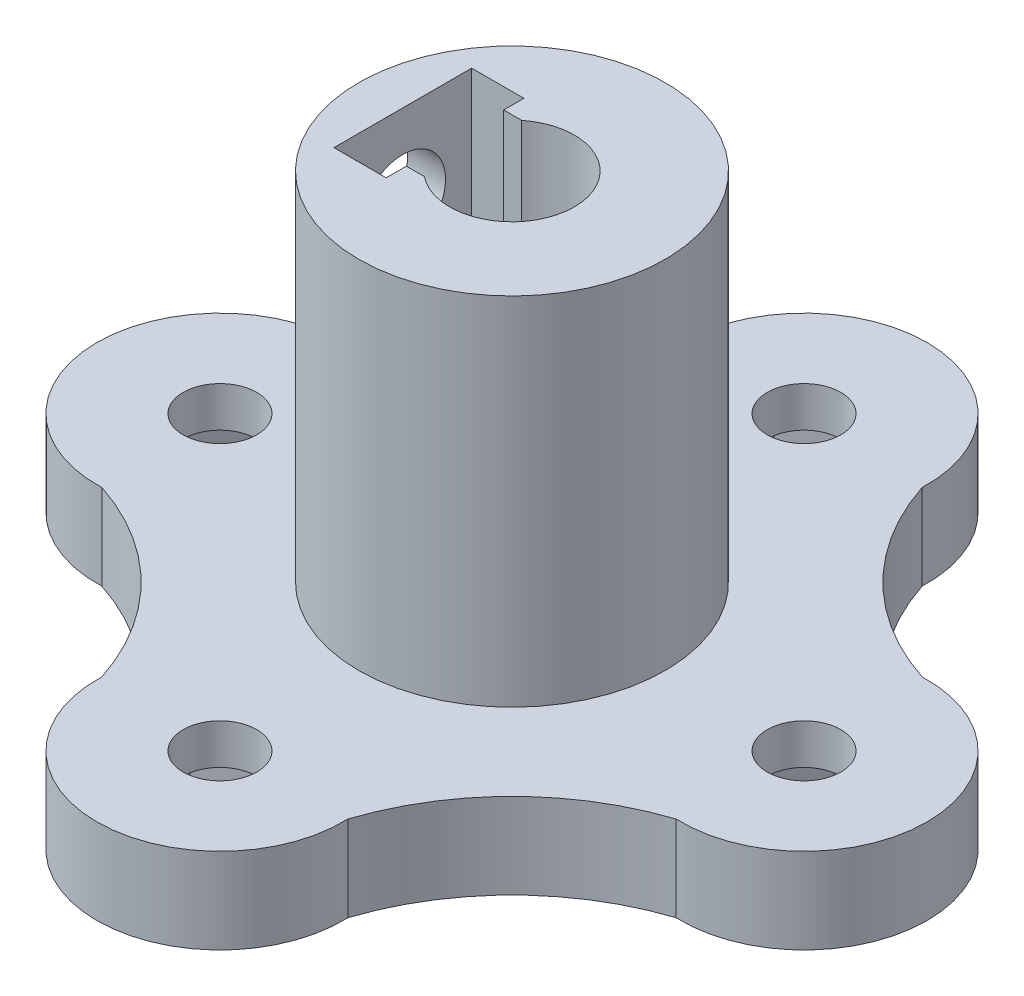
ISO-10303-21;
HEADER;
FILE_DESCRIPTION(('STEP AP214'),'2;1');
FILE_NAME('part.step','',(''),(''),'','','');
FILE_SCHEMA(('AUTOMOTIVE_DESIGN { 1 0 10303 214 1 1 1 1 }'));
ENDSEC;
DATA;
#1=APPLICATION_CONTEXT('core data for automotive mechanical design processes');
#2=APPLICATION_PROTOCOL_DEFINITION('international standard','automotive_design',2000,#1);
#3=PRODUCT_CONTEXT('',#1,'mechanical');
#4=PRODUCT('Part','Part','',(#3));
#5=PRODUCT_RELATED_PRODUCT_CATEGORY('part','',(#4));
#6=PRODUCT_DEFINITION_FORMATION('','',#4);
#7=PRODUCT_DEFINITION_CONTEXT('part definition',#1,'design');
#8=PRODUCT_DEFINITION('design','',#6,#7);
#9=PRODUCT_DEFINITION_SHAPE('','',#8);
#10=(LENGTH_UNIT() NAMED_UNIT(*) SI_UNIT(.MILLI.,.METRE.));
#11=(NAMED_UNIT(*) PLANE_ANGLE_UNIT() SI_UNIT($,.RADIAN.));
#12=(NAMED_UNIT(*) SI_UNIT($,.STERADIAN.) SOLID_ANGLE_UNIT());
#13=UNCERTAINTY_MEASURE_WITH_UNIT(LENGTH_MEASURE(1.E-05),#10,'distance_accuracy_value','');
#14=(GEOMETRIC_REPRESENTATION_CONTEXT(3) GLOBAL_UNCERTAINTY_ASSIGNED_CONTEXT((#13)) GLOBAL_UNIT_ASSIGNED_CONTEXT((#10,
#11,#12)) REPRESENTATION_CONTEXT('',''));
#15=CARTESIAN_POINT('',(0.,0.,0.));
#16=DIRECTION('',(0.,0.,1.));
#17=DIRECTION('',(1.,0.,0.));
#18=AXIS2_PLACEMENT_3D('',#15,#16,#17);
#19=CARTESIAN_POINT('',(0.,3.6,-12.3));
#20=DIRECTION('',(0.,-1.,0.));
#21=DIRECTION('',(0.,0.,-1.));
#22=AXIS2_PLACEMENT_3D('',#19,#20,#21);
#23=CYLINDRICAL_SURFACE('',#22,1.55);
#24=CARTESIAN_POINT('',(0.,3.6,-12.3));
#25=DIRECTION('',(0.,1.,0.));
#26=DIRECTION('',(0.,0.,1.));
#27=AXIS2_PLACEMENT_3D('',#24,#25,#26);
#28=CIRCLE('',#27,1.55);
#29=CARTESIAN_POINT('',(0.,3.6,-10.75));
#30=VERTEX_POINT('',#29);
#31=EDGE_CURVE('E748',#30,#30,#28,.T.);
#32=ORIENTED_EDGE('',*,*,#31,.T.);
#33=EDGE_LOOP('',(#32));
#34=FACE_BOUND('',#33,.T.);
#35=CARTESIAN_POINT('',(0.,1.9,-12.3));
#36=DIRECTION('',(0.,-1.,0.));
#37=DIRECTION('',(0.,0.,-1.));
#38=AXIS2_PLACEMENT_3D('',#35,#36,#37);
#39=CIRCLE('',#38,1.55);
#40=CARTESIAN_POINT('',(0.,1.9,-13.85));
#41=VERTEX_POINT('',#40);
#42=EDGE_CURVE('E615',#41,#41,#39,.T.);
#43=ORIENTED_EDGE('',*,*,#42,.T.);
#44=EDGE_LOOP('',(#43));
#45=FACE_BOUND('',#44,.T.);
#46=ADVANCED_FACE('F41',(#34,#45),#23,.F.);
#47=CARTESIAN_POINT('',(12.3,3.6,0.));
#48=DIRECTION('',(0.,-1.,0.));
#49=DIRECTION('',(0.,0.,-1.));
#50=AXIS2_PLACEMENT_3D('',#47,#48,#49);
#51=CYLINDRICAL_SURFACE('',#50,1.55);
#52=CARTESIAN_POINT('',(12.3,3.6,0.));
#53=DIRECTION('',(0.,1.,0.));
#54=DIRECTION('',(0.,0.,1.));
#55=AXIS2_PLACEMENT_3D('',#52,#53,#54);
#56=CIRCLE('',#55,1.55);
#57=CARTESIAN_POINT('',(12.3,3.6,1.55));
#58=VERTEX_POINT('',#57);
#59=EDGE_CURVE('E744',#58,#58,#56,.T.);
#60=ORIENTED_EDGE('',*,*,#59,.T.);
#61=EDGE_LOOP('',(#60));
#62=FACE_BOUND('',#61,.T.);
#63=CARTESIAN_POINT('',(12.3,1.9,0.));
#64=DIRECTION('',(0.,-1.,0.));
#65=DIRECTION('',(0.,0.,-1.));
#66=AXIS2_PLACEMENT_3D('',#63,#64,#65);
#67=CIRCLE('',#66,1.55);
#68=CARTESIAN_POINT('',(12.3,1.9,-1.55));
#69=VERTEX_POINT('',#68);
#70=EDGE_CURVE('E779',#69,#69,#67,.T.);
#71=ORIENTED_EDGE('',*,*,#70,.T.);
#72=EDGE_LOOP('',(#71));
#73=FACE_BOUND('',#72,.T.);
#74=ADVANCED_FACE('F844',(#62,#73),#51,.F.);
#75=CARTESIAN_POINT('',(0.,3.6,12.3));
#76=DIRECTION('',(0.,-1.,0.));
#77=DIRECTION('',(0.,0.,-1.));
#78=AXIS2_PLACEMENT_3D('',#75,#76,#77);
#79=CYLINDRICAL_SURFACE('',#78,1.55);
#80=CARTESIAN_POINT('',(0.,3.6,12.3));
#81=DIRECTION('',(0.,1.,0.));
#82=DIRECTION('',(0.,0.,1.));
#83=AXIS2_PLACEMENT_3D('',#80,#81,#82);
#84=CIRCLE('',#83,1.55);
#85=CARTESIAN_POINT('',(0.,3.6,13.85));
#86=VERTEX_POINT('',#85);
#87=EDGE_CURVE('E740',#86,#86,#84,.T.);
#88=ORIENTED_EDGE('',*,*,#87,.T.);
#89=EDGE_LOOP('',(#88));
#90=FACE_BOUND('',#89,.T.);
#91=CARTESIAN_POINT('',(0.,1.9,12.3));
#92=DIRECTION('',(0.,-1.,0.));
#93=DIRECTION('',(0.,0.,-1.));
#94=AXIS2_PLACEMENT_3D('',#91,#92,#93);
#95=CIRCLE('',#94,1.55);
#96=CARTESIAN_POINT('',(0.,1.9,10.75));
#97=VERTEX_POINT('',#96);
#98=EDGE_CURVE('E775',#97,#97,#95,.T.);
#99=ORIENTED_EDGE('',*,*,#98,.T.);
#100=EDGE_LOOP('',(#99));
#101=FACE_BOUND('',#100,.T.);
#102=ADVANCED_FACE('F849',(#90,#101),#79,.F.);
#103=CARTESIAN_POINT('',(-12.3,3.6,0.));
#104=DIRECTION('',(0.,-1.,0.));
#105=DIRECTION('',(0.,0.,-1.));
#106=AXIS2_PLACEMENT_3D('',#103,#104,#105);
#107=CYLINDRICAL_SURFACE('',#106,1.55);
#108=CARTESIAN_POINT('',(-12.3,3.6,0.));
#109=DIRECTION('',(0.,1.,0.));
#110=DIRECTION('',(0.,0.,1.));
#111=AXIS2_PLACEMENT_3D('',#108,#109,#110);
#112=CIRCLE('',#111,1.55);
#113=CARTESIAN_POINT('',(-12.3,3.6,1.55));
#114=VERTEX_POINT('',#113);
#115=EDGE_CURVE('E733',#114,#114,#112,.T.);
#116=ORIENTED_EDGE('',*,*,#115,.T.);
#117=EDGE_LOOP('',(#116));
#118=FACE_BOUND('',#117,.T.);
#119=CARTESIAN_POINT('',(-12.3,1.9,0.));
#120=DIRECTION('',(0.,-1.,0.));
#121=DIRECTION('',(0.,0.,-1.));
#122=AXIS2_PLACEMENT_3D('',#119,#120,#121);
#123=CIRCLE('',#122,1.55);
#124=CARTESIAN_POINT('',(-12.3,1.9,-1.55));
#125=VERTEX_POINT('',#124);
#126=EDGE_CURVE('E399',#125,#125,#123,.T.);
#127=ORIENTED_EDGE('',*,*,#126,.T.);
#128=EDGE_LOOP('',(#127));
#129=FACE_BOUND('',#128,.T.);
#130=ADVANCED_FACE('F855',(#118,#129),#107,.F.);
#131=CARTESIAN_POINT('',(0.,3.6,0.));
#132=DIRECTION('',(0.,1.,0.));
#133=DIRECTION('',(0.,0.,1.));
#134=AXIS2_PLACEMENT_3D('',#131,#132,#133);
#135=PLANE('',#134);
#136=CARTESIAN_POINT('',(15.4384532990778,3.6,15.4384532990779));
#137=DIRECTION('',(0.,1.,0.));
#138=DIRECTION('',(-1.,0.,0.));
#139=AXIS2_PLACEMENT_3D('',#136,#137,#138);
#140=CIRCLE('',#139,10.7883985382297);
#141=CARTESIAN_POINT('',(12.0957464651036,3.6,5.18097534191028));
#142=VERTEX_POINT('',#141);
#143=CARTESIAN_POINT('',(5.18097534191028,3.6,12.0957464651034));
#144=VERTEX_POINT('',#143);
#145=EDGE_CURVE('E628',#142,#144,#140,.T.);
#146=ORIENTED_EDGE('',*,*,#145,.F.);
#147=CARTESIAN_POINT('',(12.3,3.6,0.));
#148=DIRECTION('',(0.,1.,0.));
#149=DIRECTION('',(0.,0.,1.));
#150=AXIS2_PLACEMENT_3D('',#147,#148,#149);
#151=CIRCLE('',#150,5.185);
#152=CARTESIAN_POINT('',(12.0957464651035,3.6,-5.18097534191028));
#153=VERTEX_POINT('',#152);
#154=EDGE_CURVE('E667',#142,#153,#151,.T.);
#155=ORIENTED_EDGE('',*,*,#154,.T.);
#156=CARTESIAN_POINT('',(15.4384532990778,3.6,-15.4384532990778));
#157=DIRECTION('',(0.,1.,0.));
#158=DIRECTION('',(0.,0.,1.));
#159=AXIS2_PLACEMENT_3D('',#156,#157,#158);
#160=CIRCLE('',#159,10.7883985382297);
#161=CARTESIAN_POINT('',(5.18097534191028,3.6,-12.0957464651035));
#162=VERTEX_POINT('',#161);
#163=EDGE_CURVE('E636',#162,#153,#160,.T.);
#164=ORIENTED_EDGE('',*,*,#163,.F.);
#165=CARTESIAN_POINT('',(0.,3.6,-12.3));
#166=DIRECTION('',(0.,1.,0.));
#167=DIRECTION('',(0.,0.,1.));
#168=AXIS2_PLACEMENT_3D('',#165,#166,#167);
#169=CIRCLE('',#168,5.185);
#170=CARTESIAN_POINT('',(-5.18097534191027,3.6,-12.0957464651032));
#171=VERTEX_POINT('',#170);
#172=EDGE_CURVE('E674',#162,#171,#169,.T.);
#173=ORIENTED_EDGE('',*,*,#172,.T.);
#174=CARTESIAN_POINT('',(-15.4384532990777,3.6,-15.438453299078));
#175=DIRECTION('',(0.,1.,0.));
#176=DIRECTION('',(1.,0.,0.));
#177=AXIS2_PLACEMENT_3D('',#174,#175,#176);
#178=CIRCLE('',#177,10.7883985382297);
#179=CARTESIAN_POINT('',(-12.0957464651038,3.6,-5.18097534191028));
#180=VERTEX_POINT('',#179);
#181=EDGE_CURVE('E627',#180,#171,#178,.T.);
#182=ORIENTED_EDGE('',*,*,#181,.F.);
#183=CARTESIAN_POINT('',(-12.3,3.6,0.));
#184=DIRECTION('',(0.,1.,0.));
#185=DIRECTION('',(0.,0.,1.));
#186=AXIS2_PLACEMENT_3D('',#183,#184,#185);
#187=CIRCLE('',#186,5.185);
#188=CARTESIAN_POINT('',(-12.0957464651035,3.6,5.18097534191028));
#189=VERTEX_POINT('',#188);
#190=EDGE_CURVE('E655',#180,#189,#187,.T.);
#191=ORIENTED_EDGE('',*,*,#190,.T.);
#192=CARTESIAN_POINT('',(-15.4384532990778,3.6,15.4384532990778));
#193=DIRECTION('',(0.,1.,0.));
#194=DIRECTION('',(0.,0.,-1.));
#195=AXIS2_PLACEMENT_3D('',#192,#193,#194);
#196=CIRCLE('',#195,10.7883985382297);
#197=CARTESIAN_POINT('',(-5.18097534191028,3.6,12.0957464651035));
#198=VERTEX_POINT('',#197);
#199=EDGE_CURVE('E637',#198,#189,#196,.T.);
#200=ORIENTED_EDGE('',*,*,#199,.F.);
#201=CARTESIAN_POINT('',(0.,3.6,12.3));
#202=DIRECTION('',(0.,1.,0.));
#203=DIRECTION('',(0.,0.,1.));
#204=AXIS2_PLACEMENT_3D('',#201,#202,#203);
#205=CIRCLE('',#204,5.185);
#206=EDGE_CURVE('E660',#198,#144,#205,.T.);
#207=ORIENTED_EDGE('',*,*,#206,.T.);
#208=EDGE_LOOP('',(#146,#155,#164,#173,#182,#191,#200,#207));
#209=FACE_BOUND('',#208,.T.);
#210=CARTESIAN_POINT('',(0.,3.6,0.));
#211=DIRECTION('',(0.,1.,0.));
#212=DIRECTION('',(0.,0.,1.));
#213=AXIS2_PLACEMENT_3D('',#210,#211,#212);
#214=CIRCLE('',#213,6.45);
#215=CARTESIAN_POINT('',(0.,3.6,6.45));
#216=VERTEX_POINT('',#215);
#217=EDGE_CURVE('E728',#216,#216,#214,.T.);
#218=ORIENTED_EDGE('',*,*,#217,.F.);
#219=EDGE_LOOP('',(#218));
#220=FACE_BOUND('',#219,.T.);
#221=ORIENTED_EDGE('',*,*,#87,.F.);
#222=EDGE_LOOP('',(#221));
#223=FACE_BOUND('',#222,.T.);
#224=ORIENTED_EDGE('',*,*,#115,.F.);
#225=EDGE_LOOP('',(#224));
#226=FACE_BOUND('',#225,.T.);
#227=ORIENTED_EDGE('',*,*,#31,.F.);
#228=EDGE_LOOP('',(#227));
#229=FACE_BOUND('',#228,.T.);
#230=ORIENTED_EDGE('',*,*,#59,.F.);
#231=EDGE_LOOP('',(#230));
#232=FACE_BOUND('',#231,.T.);
#233=ADVANCED_FACE('F817',(#209,#220,#223,#226,#229,#232),#135,.T.);
#234=CARTESIAN_POINT('',(0.,0.,0.));
#235=DIRECTION('',(0.,1.,0.));
#236=DIRECTION('',(0.,0.,1.));
#237=AXIS2_PLACEMENT_3D('',#234,#235,#236);
#238=PLANE('',#237);
#239=DIRECTION('',(-0.866025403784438,0.,-0.5));
#240=VECTOR('',#239,1.);
#241=CARTESIAN_POINT('',(0.,0.,-8.83589838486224));
#242=LINE('',#241,#240);
#243=CARTESIAN_POINT('',(0.,0.,-8.83589838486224));
#244=VERTEX_POINT('',#243);
#245=CARTESIAN_POINT('',(-3.00000000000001,0.,-10.5679491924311));
#246=VERTEX_POINT('',#245);
#247=EDGE_CURVE('E376',#244,#246,#242,.T.);
#248=ORIENTED_EDGE('',*,*,#247,.F.);
#249=DIRECTION('',(-0.866025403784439,0.,0.5));
#250=VECTOR('',#249,1.);
#251=CARTESIAN_POINT('',(3.,0.,-10.5679491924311));
#252=LINE('',#251,#250);
#253=CARTESIAN_POINT('',(3.,0.,-10.5679491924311));
#254=VERTEX_POINT('',#253);
#255=EDGE_CURVE('E70',#254,#244,#252,.T.);
#256=ORIENTED_EDGE('',*,*,#255,.F.);
#257=DIRECTION('',(0.,0.,1.));
#258=VECTOR('',#257,1.);
#259=CARTESIAN_POINT('',(3.,0.,-14.0320508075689));
#260=LINE('',#259,#258);
#261=CARTESIAN_POINT('',(3.,0.,-14.0320508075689));
#262=VERTEX_POINT('',#261);
#263=EDGE_CURVE('E353',#262,#254,#260,.T.);
#264=ORIENTED_EDGE('',*,*,#263,.F.);
#265=DIRECTION('',(0.866025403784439,0.,0.500000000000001));
#266=VECTOR('',#265,1.);
#267=CARTESIAN_POINT('',(0.,0.,-15.7641016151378));
#268=LINE('',#267,#266);
#269=CARTESIAN_POINT('',(0.,0.,-15.7641016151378));
#270=VERTEX_POINT('',#269);
#271=EDGE_CURVE('E389',#270,#262,#268,.T.);
#272=ORIENTED_EDGE('',*,*,#271,.F.);
#273=DIRECTION('',(0.866025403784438,0.,-0.5));
#274=VECTOR('',#273,1.);
#275=CARTESIAN_POINT('',(-3.00000000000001,0.,-14.0320508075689));
#276=LINE('',#275,#274);
#277=CARTESIAN_POINT('',(-3.00000000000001,0.,-14.0320508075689));
#278=VERTEX_POINT('',#277);
#279=EDGE_CURVE('E385',#278,#270,#276,.T.);
#280=ORIENTED_EDGE('',*,*,#279,.F.);
#281=DIRECTION('',(0.,0.,-1.));
#282=VECTOR('',#281,1.);
#283=CARTESIAN_POINT('',(-3.00000000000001,0.,-10.5679491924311));
#284=LINE('',#283,#282);
#285=EDGE_CURVE('E381',#246,#278,#284,.T.);
#286=ORIENTED_EDGE('',*,*,#285,.F.);
#287=EDGE_LOOP('',(#248,#256,#264,#272,#280,#286));
#288=FACE_BOUND('',#287,.T.);
#289=DIRECTION('',(-0.5,0.,0.866025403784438));
#290=VECTOR('',#289,1.);
#291=CARTESIAN_POINT('',(-8.83589838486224,0.,0.));
#292=LINE('',#291,#290);
#293=CARTESIAN_POINT('',(-8.83589838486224,0.,0.));
#294=VERTEX_POINT('',#293);
#295=CARTESIAN_POINT('',(-10.5679491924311,0.,3.00000000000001));
#296=VERTEX_POINT('',#295);
#297=EDGE_CURVE('E443',#294,#296,#292,.T.);
#298=ORIENTED_EDGE('',*,*,#297,.F.);
#299=DIRECTION('',(0.5,0.,0.866025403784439));
#300=VECTOR('',#299,1.);
#301=CARTESIAN_POINT('',(-10.5679491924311,0.,-3.));
#302=LINE('',#301,#300);
#303=CARTESIAN_POINT('',(-10.5679491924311,0.,-3.));
#304=VERTEX_POINT('',#303);
#305=EDGE_CURVE('E440',#304,#294,#302,.T.);
#306=ORIENTED_EDGE('',*,*,#305,.F.);
#307=DIRECTION('',(1.,0.,0.));
#308=VECTOR('',#307,1.);
#309=CARTESIAN_POINT('',(-14.0320508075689,0.,-3.));
#310=LINE('',#309,#308);
#311=CARTESIAN_POINT('',(-14.0320508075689,0.,-3.));
#312=VERTEX_POINT('',#311);
#313=EDGE_CURVE('E419',#312,#304,#310,.T.);
#314=ORIENTED_EDGE('',*,*,#313,.F.);
#315=DIRECTION('',(0.500000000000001,0.,-0.866025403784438));
#316=VECTOR('',#315,1.);
#317=CARTESIAN_POINT('',(-15.7641016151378,0.,0.));
#318=LINE('',#317,#316);
#319=CARTESIAN_POINT('',(-15.7641016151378,0.,0.));
#320=VERTEX_POINT('',#319);
#321=EDGE_CURVE('E456',#320,#312,#318,.T.);
#322=ORIENTED_EDGE('',*,*,#321,.F.);
#323=DIRECTION('',(-0.5,0.,-0.866025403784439));
#324=VECTOR('',#323,1.);
#325=CARTESIAN_POINT('',(-14.0320508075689,0.,3.00000000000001));
#326=LINE('',#325,#324);
#327=CARTESIAN_POINT('',(-14.0320508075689,0.,3.00000000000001));
#328=VERTEX_POINT('',#327);
#329=EDGE_CURVE('E452',#328,#320,#326,.T.);
#330=ORIENTED_EDGE('',*,*,#329,.F.);
#331=DIRECTION('',(-1.,0.,0.));
#332=VECTOR('',#331,1.);
#333=CARTESIAN_POINT('',(-10.5679491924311,0.,3.00000000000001));
#334=LINE('',#333,#332);
#335=EDGE_CURVE('E448',#296,#328,#334,.T.);
#336=ORIENTED_EDGE('',*,*,#335,.F.);
#337=EDGE_LOOP('',(#298,#306,#314,#322,#330,#336));
#338=FACE_BOUND('',#337,.T.);
#339=DIRECTION('',(0.866025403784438,0.,0.5));
#340=VECTOR('',#339,1.);
#341=CARTESIAN_POINT('',(0.,0.,8.83589838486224));
#342=LINE('',#341,#340);
#343=CARTESIAN_POINT('',(0.,0.,8.83589838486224));
#344=VERTEX_POINT('',#343);
#345=CARTESIAN_POINT('',(3.,0.,10.5679491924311));
#346=VERTEX_POINT('',#345);
#347=EDGE_CURVE('E509',#344,#346,#342,.T.);
#348=ORIENTED_EDGE('',*,*,#347,.F.);
#349=DIRECTION('',(0.866025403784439,0.,-0.5));
#350=VECTOR('',#349,1.);
#351=CARTESIAN_POINT('',(-3.,0.,10.5679491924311));
#352=LINE('',#351,#350);
#353=CARTESIAN_POINT('',(-3.,0.,10.5679491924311));
#354=VERTEX_POINT('',#353);
#355=EDGE_CURVE('E506',#354,#344,#352,.T.);
#356=ORIENTED_EDGE('',*,*,#355,.F.);
#357=DIRECTION('',(0.,0.,-1.));
#358=VECTOR('',#357,1.);
#359=CARTESIAN_POINT('',(-3.,0.,14.0320508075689));
#360=LINE('',#359,#358);
#361=CARTESIAN_POINT('',(-3.,0.,14.0320508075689));
#362=VERTEX_POINT('',#361);
#363=EDGE_CURVE('E485',#362,#354,#360,.T.);
#364=ORIENTED_EDGE('',*,*,#363,.F.);
#365=DIRECTION('',(-0.866025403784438,0.,-0.500000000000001));
#366=VECTOR('',#365,1.);
#367=CARTESIAN_POINT('',(0.,0.,15.7641016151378));
#368=LINE('',#367,#366);
#369=CARTESIAN_POINT('',(0.,0.,15.7641016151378));
#370=VERTEX_POINT('',#369);
#371=EDGE_CURVE('E522',#370,#362,#368,.T.);
#372=ORIENTED_EDGE('',*,*,#371,.F.);
#373=DIRECTION('',(-0.866025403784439,0.,0.5));
#374=VECTOR('',#373,1.);
#375=CARTESIAN_POINT('',(3.,0.,14.0320508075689));
#376=LINE('',#375,#374);
#377=CARTESIAN_POINT('',(3.,0.,14.0320508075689));
#378=VERTEX_POINT('',#377);
#379=EDGE_CURVE('E518',#378,#370,#376,.T.);
#380=ORIENTED_EDGE('',*,*,#379,.F.);
#381=DIRECTION('',(0.,0.,1.));
#382=VECTOR('',#381,1.);
#383=CARTESIAN_POINT('',(3.,0.,10.5679491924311));
#384=LINE('',#383,#382);
#385=EDGE_CURVE('E514',#346,#378,#384,.T.);
#386=ORIENTED_EDGE('',*,*,#385,.F.);
#387=EDGE_LOOP('',(#348,#356,#364,#372,#380,#386));
#388=FACE_BOUND('',#387,.T.);
#389=DIRECTION('',(0.500000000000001,0.,-0.866025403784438));
#390=VECTOR('',#389,1.);
#391=CARTESIAN_POINT('',(8.83589838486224,0.,0.));
#392=LINE('',#391,#390);
#393=CARTESIAN_POINT('',(8.83589838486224,0.,0.));
#394=VERTEX_POINT('',#393);
#395=CARTESIAN_POINT('',(10.5679491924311,0.,-3.));
#396=VERTEX_POINT('',#395);
#397=EDGE_CURVE('E574',#394,#396,#392,.T.);
#398=ORIENTED_EDGE('',*,*,#397,.F.);
#399=DIRECTION('',(-0.499999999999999,0.,-0.866025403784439));
#400=VECTOR('',#399,1.);
#401=CARTESIAN_POINT('',(10.5679491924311,0.,3.));
#402=LINE('',#401,#400);
#403=CARTESIAN_POINT('',(10.5679491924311,0.,3.));
#404=VERTEX_POINT('',#403);
#405=EDGE_CURVE('E347',#404,#394,#402,.T.);
#406=ORIENTED_EDGE('',*,*,#405,.F.);
#407=DIRECTION('',(-1.,0.,0.));
#408=VECTOR('',#407,1.);
#409=CARTESIAN_POINT('',(14.0320508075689,0.,3.));
#410=LINE('',#409,#408);
#411=CARTESIAN_POINT('',(14.0320508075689,0.,3.));
#412=VERTEX_POINT('',#411);
#413=EDGE_CURVE('E551',#412,#404,#410,.T.);
#414=ORIENTED_EDGE('',*,*,#413,.F.);
#415=DIRECTION('',(-0.500000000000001,0.,0.866025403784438));
#416=VECTOR('',#415,1.);
#417=CARTESIAN_POINT('',(15.7641016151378,0.,0.));
#418=LINE('',#417,#416);
#419=CARTESIAN_POINT('',(15.7641016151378,0.,0.));
#420=VERTEX_POINT('',#419);
#421=EDGE_CURVE('E586',#420,#412,#418,.T.);
#422=ORIENTED_EDGE('',*,*,#421,.F.);
#423=DIRECTION('',(0.5,0.,0.866025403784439));
#424=VECTOR('',#423,1.);
#425=CARTESIAN_POINT('',(14.0320508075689,0.,-3.));
#426=LINE('',#425,#424);
#427=CARTESIAN_POINT('',(14.0320508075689,0.,-3.));
#428=VERTEX_POINT('',#427);
#429=EDGE_CURVE('E582',#428,#420,#426,.T.);
#430=ORIENTED_EDGE('',*,*,#429,.F.);
#431=DIRECTION('',(1.,0.,0.));
#432=VECTOR('',#431,1.);
#433=CARTESIAN_POINT('',(10.5679491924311,0.,-3.));
#434=LINE('',#433,#432);
#435=EDGE_CURVE('E578',#396,#428,#434,.T.);
#436=ORIENTED_EDGE('',*,*,#435,.F.);
#437=EDGE_LOOP('',(#398,#406,#414,#422,#430,#436));
#438=FACE_BOUND('',#437,.T.);
#439=CARTESIAN_POINT('',(15.4384532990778,0.,-15.4384532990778));
#440=DIRECTION('',(0.,1.,0.));
#441=DIRECTION('',(0.,0.,1.));
#442=AXIS2_PLACEMENT_3D('',#439,#440,#441);
#443=CIRCLE('',#442,10.7883985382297);
#444=CARTESIAN_POINT('',(12.0957464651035,0.,-5.18097534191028));
#445=VERTEX_POINT('',#444);
#446=CARTESIAN_POINT('',(5.18097534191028,0.,-12.0957464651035));
#447=VERTEX_POINT('',#446);
#448=EDGE_CURVE('E652',#445,#447,#443,.F.);
#449=ORIENTED_EDGE('',*,*,#448,.F.);
#450=CARTESIAN_POINT('',(12.3,0.,0.));
#451=DIRECTION('',(0.,1.,0.));
#452=DIRECTION('',(0.,0.,1.));
#453=AXIS2_PLACEMENT_3D('',#450,#451,#452);
#454=CIRCLE('',#453,5.185);
#455=CARTESIAN_POINT('',(12.0957464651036,0.,5.18097534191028));
#456=VERTEX_POINT('',#455);
#457=EDGE_CURVE('E671',#445,#456,#454,.F.);
#458=ORIENTED_EDGE('',*,*,#457,.T.);
#459=CARTESIAN_POINT('',(15.4384532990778,0.,15.4384532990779));
#460=DIRECTION('',(0.,1.,0.));
#461=DIRECTION('',(0.,0.,1.));
#462=AXIS2_PLACEMENT_3D('',#459,#460,#461);
#463=CIRCLE('',#462,10.7883985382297);
#464=CARTESIAN_POINT('',(5.18097534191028,0.,12.0957464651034));
#465=VERTEX_POINT('',#464);
#466=EDGE_CURVE('E631',#465,#456,#463,.F.);
#467=ORIENTED_EDGE('',*,*,#466,.F.);
#468=CARTESIAN_POINT('',(0.,0.,12.3));
#469=DIRECTION('',(0.,1.,0.));
#470=DIRECTION('',(0.,0.,1.));
#471=AXIS2_PLACEMENT_3D('',#468,#469,#470);
#472=CIRCLE('',#471,5.185);
#473=CARTESIAN_POINT('',(-5.18097534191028,0.,12.0957464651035));
#474=VERTEX_POINT('',#473);
#475=EDGE_CURVE('E663',#465,#474,#472,.F.);
#476=ORIENTED_EDGE('',*,*,#475,.T.);
#477=CARTESIAN_POINT('',(-15.4384532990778,0.,15.4384532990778));
#478=DIRECTION('',(0.,1.,0.));
#479=DIRECTION('',(0.,0.,1.));
#480=AXIS2_PLACEMENT_3D('',#477,#478,#479);
#481=CIRCLE('',#480,10.7883985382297);
#482=CARTESIAN_POINT('',(-12.0957464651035,0.,5.18097534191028));
#483=VERTEX_POINT('',#482);
#484=EDGE_CURVE('E632',#483,#474,#481,.F.);
#485=ORIENTED_EDGE('',*,*,#484,.F.);
#486=CARTESIAN_POINT('',(-12.3,0.,0.));
#487=DIRECTION('',(0.,1.,0.));
#488=DIRECTION('',(0.,0.,1.));
#489=AXIS2_PLACEMENT_3D('',#486,#487,#488);
#490=CIRCLE('',#489,5.185);
#491=CARTESIAN_POINT('',(-12.0957464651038,0.,-5.18097534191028));
#492=VERTEX_POINT('',#491);
#493=EDGE_CURVE('E656',#483,#492,#490,.F.);
#494=ORIENTED_EDGE('',*,*,#493,.T.);
#495=CARTESIAN_POINT('',(-15.4384532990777,0.,-15.438453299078));
#496=DIRECTION('',(0.,1.,0.));
#497=DIRECTION('',(0.,0.,1.));
#498=AXIS2_PLACEMENT_3D('',#495,#496,#497);
#499=CIRCLE('',#498,10.7883985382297);
#500=CARTESIAN_POINT('',(-5.18097534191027,0.,-12.0957464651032));
#501=VERTEX_POINT('',#500);
#502=EDGE_CURVE('E641',#501,#492,#499,.F.);
#503=ORIENTED_EDGE('',*,*,#502,.F.);
#504=CARTESIAN_POINT('',(0.,0.,-12.3));
#505=DIRECTION('',(0.,1.,0.));
#506=DIRECTION('',(0.,0.,1.));
#507=AXIS2_PLACEMENT_3D('',#504,#505,#506);
#508=CIRCLE('',#507,5.185);
#509=EDGE_CURVE('E677',#501,#447,#508,.F.);
#510=ORIENTED_EDGE('',*,*,#509,.T.);
#511=EDGE_LOOP('',(#449,#458,#467,#476,#485,#494,#503,#510));
#512=FACE_BOUND('',#511,.T.);
#513=CARTESIAN_POINT('',(0.,0.,0.));
#514=DIRECTION('',(0.,1.,0.));
#515=DIRECTION('',(0.,0.,1.));
#516=AXIS2_PLACEMENT_3D('',#513,#514,#515);
#517=CIRCLE('',#516,2.625);
#518=CARTESIAN_POINT('',(0.,0.,2.625));
#519=VERTEX_POINT('',#518);
#520=EDGE_CURVE('E752',#519,#519,#517,.T.);
#521=ORIENTED_EDGE('',*,*,#520,.T.);
#522=EDGE_LOOP('',(#521));
#523=FACE_BOUND('',#522,.T.);
#524=ADVANCED_FACE('F43',(#288,#338,#388,#438,#512,#523),#238,.F.);
#525=CARTESIAN_POINT('',(0.,3.6,0.));
#526=DIRECTION('',(0.,-1.,0.));
#527=DIRECTION('',(0.,0.,-1.));
#528=AXIS2_PLACEMENT_3D('',#525,#526,#527);
#529=CYLINDRICAL_SURFACE('',#528,2.625);
#530=DIRECTION('',(0.,-1.,0.));
#531=VECTOR('',#530,1.);
#532=CARTESIAN_POINT('',(-1.63955024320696,3.6,-2.05));
#533=LINE('',#532,#531);
#534=CARTESIAN_POINT('',(-1.63955024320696,11.6,-2.05));
#535=VERTEX_POINT('',#534);
#536=CARTESIAN_POINT('',(-1.63955024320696,18.6,-2.05));
#537=VERTEX_POINT('',#536);
#538=EDGE_CURVE('E311',#535,#537,#533,.F.);
#539=ORIENTED_EDGE('',*,*,#538,.F.);
#540=CARTESIAN_POINT('',(0.,11.6,0.));
#541=DIRECTION('',(0.,1.,0.));
#542=DIRECTION('',(0.,0.,1.));
#543=AXIS2_PLACEMENT_3D('',#540,#541,#542);
#544=CIRCLE('',#543,2.625);
#545=CARTESIAN_POINT('',(-1.63955024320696,11.6,2.05));
#546=VERTEX_POINT('',#545);
#547=EDGE_CURVE('E304',#535,#546,#544,.T.);
#548=ORIENTED_EDGE('',*,*,#547,.T.);
#549=DIRECTION('',(0.,-1.,0.));
#550=VECTOR('',#549,1.);
#551=CARTESIAN_POINT('',(-1.63955024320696,3.6,2.05));
#552=LINE('',#551,#550);
#553=CARTESIAN_POINT('',(-1.63955024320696,18.6,2.05));
#554=VERTEX_POINT('',#553);
#555=EDGE_CURVE('E309',#554,#546,#552,.T.);
#556=ORIENTED_EDGE('',*,*,#555,.F.);
#557=CARTESIAN_POINT('',(0.,18.6,0.));
#558=DIRECTION('',(0.,1.,0.));
#559=DIRECTION('',(0.,0.,1.));
#560=AXIS2_PLACEMENT_3D('',#557,#558,#559);
#561=CIRCLE('',#560,2.625);
#562=EDGE_CURVE('E715',#554,#537,#561,.T.);
#563=ORIENTED_EDGE('',*,*,#562,.T.);
#564=EDGE_LOOP('',(#539,#548,#556,#563));
#565=FACE_BOUND('',#564,.T.);
#566=ORIENTED_EDGE('',*,*,#520,.F.);
#567=EDGE_LOOP('',(#566));
#568=FACE_BOUND('',#567,.T.);
#569=ADVANCED_FACE('F306',(#565,#568),#529,.F.);
#570=CARTESIAN_POINT('',(0.,18.6,0.));
#571=DIRECTION('',(0.,1.,0.));
#572=DIRECTION('',(0.,0.,1.));
#573=AXIS2_PLACEMENT_3D('',#570,#571,#572);
#574=PLANE('',#573);
#575=DIRECTION('',(-1.,0.,0.));
#576=VECTOR('',#575,1.);
#577=CARTESIAN_POINT('',(-4.6,18.6,-2.05));
#578=LINE('',#577,#576);
#579=CARTESIAN_POINT('',(-2.4,18.6,-2.05));
#580=VERTEX_POINT('',#579);
#581=EDGE_CURVE('E337',#537,#580,#578,.T.);
#582=ORIENTED_EDGE('',*,*,#581,.F.);
#583=ORIENTED_EDGE('',*,*,#562,.F.);
#584=DIRECTION('',(1.,0.,0.));
#585=VECTOR('',#584,1.);
#586=CARTESIAN_POINT('',(-4.6,18.6,2.05));
#587=LINE('',#586,#585);
#588=CARTESIAN_POINT('',(-2.4,18.6,2.05));
#589=VERTEX_POINT('',#588);
#590=EDGE_CURVE('E322',#589,#554,#587,.T.);
#591=ORIENTED_EDGE('',*,*,#590,.F.);
#592=DIRECTION('',(0.,0.,-1.));
#593=VECTOR('',#592,1.);
#594=CARTESIAN_POINT('',(-2.4,18.6,-2.9));
#595=LINE('',#594,#593);
#596=CARTESIAN_POINT('',(-2.4,18.6,2.9));
#597=VERTEX_POINT('',#596);
#598=EDGE_CURVE('E705',#597,#589,#595,.T.);
#599=ORIENTED_EDGE('',*,*,#598,.F.);
#600=DIRECTION('',(1.,0.,0.));
#601=VECTOR('',#600,1.);
#602=CARTESIAN_POINT('',(-4.6,18.6,2.9));
#603=LINE('',#602,#601);
#604=CARTESIAN_POINT('',(-4.6,18.6,2.9));
#605=VERTEX_POINT('',#604);
#606=EDGE_CURVE('E701',#605,#597,#603,.T.);
#607=ORIENTED_EDGE('',*,*,#606,.F.);
#608=DIRECTION('',(0.,0.,1.));
#609=VECTOR('',#608,1.);
#610=CARTESIAN_POINT('',(-4.6,18.6,-2.9));
#611=LINE('',#610,#609);
#612=CARTESIAN_POINT('',(-4.6,18.6,-2.9));
#613=VERTEX_POINT('',#612);
#614=EDGE_CURVE('E681',#613,#605,#611,.T.);
#615=ORIENTED_EDGE('',*,*,#614,.F.);
#616=DIRECTION('',(-1.,0.,0.));
#617=VECTOR('',#616,1.);
#618=CARTESIAN_POINT('',(-4.6,18.6,-2.9));
#619=LINE('',#618,#617);
#620=CARTESIAN_POINT('',(-2.4,18.6,-2.9));
#621=VERTEX_POINT('',#620);
#622=EDGE_CURVE('E688',#621,#613,#619,.T.);
#623=ORIENTED_EDGE('',*,*,#622,.F.);
#624=DIRECTION('',(0.,0.,-1.));
#625=VECTOR('',#624,1.);
#626=CARTESIAN_POINT('',(-2.4,18.6,0.));
#627=LINE('',#626,#625);
#628=EDGE_CURVE('E315',#580,#621,#627,.T.);
#629=ORIENTED_EDGE('',*,*,#628,.F.);
#630=EDGE_LOOP('',(#582,#583,#591,#599,#607,#615,#623,#629));
#631=FACE_BOUND('',#630,.T.);
#632=CARTESIAN_POINT('',(0.,18.6,0.));
#633=DIRECTION('',(0.,1.,0.));
#634=DIRECTION('',(0.,0.,1.));
#635=AXIS2_PLACEMENT_3D('',#632,#633,#634);
#636=CIRCLE('',#635,6.45);
#637=CARTESIAN_POINT('',(0.,18.6,6.45));
#638=VERTEX_POINT('',#637);
#639=EDGE_CURVE('E729',#638,#638,#636,.T.);
#640=ORIENTED_EDGE('',*,*,#639,.T.);
#641=EDGE_LOOP('',(#640));
#642=FACE_BOUND('',#641,.T.);
#643=ADVANCED_FACE('F834',(#631,#642),#574,.T.);
#644=CARTESIAN_POINT('',(0.,18.6,0.));
#645=DIRECTION('',(0.,-1.,0.));
#646=DIRECTION('',(0.,0.,-1.));
#647=AXIS2_PLACEMENT_3D('',#644,#645,#646);
#648=CYLINDRICAL_SURFACE('',#647,6.45);
#649=CARTESIAN_POINT('',(-6.19374684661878,15.1,1.79999999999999));
#650=CARTESIAN_POINT('',(-6.19374836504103,15.0010293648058,1.7999979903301));
#651=CARTESIAN_POINT('',(-6.19614498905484,14.9020381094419,1.79180954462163));
#652=CARTESIAN_POINT('',(-6.20544047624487,14.7069271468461,1.75934209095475));
#653=CARTESIAN_POINT('',(-6.21234132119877,14.610808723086,1.73505600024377));
#654=CARTESIAN_POINT('',(-6.22980415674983,14.4242946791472,1.6712639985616));
#655=CARTESIAN_POINT('',(-6.24036066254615,14.3338907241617,1.63178087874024));
#656=CARTESIAN_POINT('',(-6.26393822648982,14.1609727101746,1.53878835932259));
#657=CARTESIAN_POINT('',(-6.27695954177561,14.0784594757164,1.48527749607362));
#658=CARTESIAN_POINT('',(-6.30439929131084,13.9214055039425,1.36418065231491));
#659=CARTESIAN_POINT('',(-6.31884434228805,13.8471128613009,1.29627887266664));
#660=CARTESIAN_POINT('',(-6.34727510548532,13.7108080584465,1.14900600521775));
#661=CARTESIAN_POINT('',(-6.36126076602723,13.6487972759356,1.06963363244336));
#662=CARTESIAN_POINT('',(-6.38749588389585,13.5377665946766,0.899936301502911));
#663=CARTESIAN_POINT('',(-6.39971029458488,13.4889956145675,0.8094425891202));
#664=CARTESIAN_POINT('',(-6.42071990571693,13.4074562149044,0.621141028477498));
#665=CARTESIAN_POINT('',(-6.42951573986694,13.3746848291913,0.523334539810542));
#666=CARTESIAN_POINT('',(-6.44250889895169,13.32688430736,0.325775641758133));
#667=CARTESIAN_POINT('',(-6.44681555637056,13.3114326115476,0.226132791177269));
#668=CARTESIAN_POINT('',(-6.45072837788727,13.2973782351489,0.0255822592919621));
#669=CARTESIAN_POINT('',(-6.45033540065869,13.29877247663,-0.0753251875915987));
#670=CARTESIAN_POINT('',(-6.44497232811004,13.3180778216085,-0.272591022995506));
#671=CARTESIAN_POINT('',(-6.44012885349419,13.3355320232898,-0.368998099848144));
#672=CARTESIAN_POINT('',(-6.42656000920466,13.3857207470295,-0.55745627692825));
#673=CARTESIAN_POINT('',(-6.41783440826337,13.4184561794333,-0.649507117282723));
#674=CARTESIAN_POINT('',(-6.39729852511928,13.4986134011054,-0.827777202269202));
#675=CARTESIAN_POINT('',(-6.38545655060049,13.5461870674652,-0.913924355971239));
#676=CARTESIAN_POINT('',(-6.3599568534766,13.6545525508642,-1.07716508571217));
#677=CARTESIAN_POINT('',(-6.34629874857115,13.715347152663,-1.15425674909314));
#678=CARTESIAN_POINT('',(-6.31809993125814,13.8508346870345,-1.29992591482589));
#679=CARTESIAN_POINT('',(-6.30354498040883,13.9259253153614,-1.36813121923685));
#680=CARTESIAN_POINT('',(-6.27560155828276,14.0866269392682,-1.49107712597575));
#681=CARTESIAN_POINT('',(-6.26221317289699,14.1722387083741,-1.54581673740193));
#682=CARTESIAN_POINT('',(-6.23805743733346,14.3524208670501,-1.64059738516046));
#683=CARTESIAN_POINT('',(-6.22730996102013,14.4470521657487,-1.68052805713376));
#684=CARTESIAN_POINT('',(-6.20989505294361,14.6420614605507,-1.74378668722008));
#685=CARTESIAN_POINT('',(-6.20322649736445,14.7424378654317,-1.76711921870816));
#686=CARTESIAN_POINT('',(-6.19496654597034,14.9425847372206,-1.79585838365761));
#687=CARTESIAN_POINT('',(-6.1932168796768,15.0422684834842,-1.80182404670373));
#688=CARTESIAN_POINT('',(-6.19455809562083,15.2412110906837,-1.79720792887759));
#689=CARTESIAN_POINT('',(-6.19764840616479,15.3404700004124,-1.78662810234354));
#690=CARTESIAN_POINT('',(-6.20816758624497,15.5335287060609,-1.74971607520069));
#691=CARTESIAN_POINT('',(-6.21550148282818,15.6274000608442,-1.72372840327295));
#692=CARTESIAN_POINT('',(-6.23358667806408,15.8094491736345,-1.65713006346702));
#693=CARTESIAN_POINT('',(-6.24433845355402,15.8976261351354,-1.61651735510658));
#694=CARTESIAN_POINT('',(-6.26836631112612,16.0680989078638,-1.52071396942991));
#695=CARTESIAN_POINT('',(-6.28169632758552,16.1502050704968,-1.46519967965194));
#696=CARTESIAN_POINT('',(-6.30925589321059,16.3041413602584,-1.34156396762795));
#697=CARTESIAN_POINT('',(-6.3234856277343,16.3759693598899,-1.27343994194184));
#698=CARTESIAN_POINT('',(-6.35179279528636,16.5096754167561,-1.12391733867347));
#699=CARTESIAN_POINT('',(-6.3658507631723,16.57116124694,-1.04216356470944));
#700=CARTESIAN_POINT('',(-6.39176606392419,16.6795414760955,-0.869174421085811));
#701=CARTESIAN_POINT('',(-6.40362351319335,16.7264366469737,-0.777939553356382));
#702=CARTESIAN_POINT('',(-6.42372560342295,16.8038614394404,-0.589216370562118));
#703=CARTESIAN_POINT('',(-6.43199746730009,16.8345147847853,-0.491781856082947));
#704=CARTESIAN_POINT('',(-6.44411650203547,16.8789323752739,-0.292876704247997));
#705=CARTESIAN_POINT('',(-6.44796475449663,16.8927007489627,-0.191407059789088));
#706=CARTESIAN_POINT('',(-6.45074653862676,16.9026786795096,0.00903858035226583));
#707=CARTESIAN_POINT('',(-6.44984041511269,16.8994610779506,0.10798422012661));
#708=CARTESIAN_POINT('',(-6.44358337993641,16.8769026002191,0.303868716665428));
#709=CARTESIAN_POINT('',(-6.43823266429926,16.8575624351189,0.400807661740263));
#710=CARTESIAN_POINT('',(-6.42372469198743,16.80364359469,0.589168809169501));
#711=CARTESIAN_POINT('',(-6.41459893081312,16.7691908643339,0.680629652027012));
#712=CARTESIAN_POINT('',(-6.39349065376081,16.6861368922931,0.856523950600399));
#713=CARTESIAN_POINT('',(-6.38150770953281,16.6375335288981,0.940956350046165));
#714=CARTESIAN_POINT('',(-6.35553085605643,16.5259362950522,1.10302367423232));
#715=CARTESIAN_POINT('',(-6.34148914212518,16.4625697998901,1.18039431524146));
#716=CARTESIAN_POINT('',(-6.31315532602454,16.3239387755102,1.32359717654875));
#717=CARTESIAN_POINT('',(-6.29886315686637,16.2486710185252,1.38942625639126));
#718=CARTESIAN_POINT('',(-6.27123641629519,16.0861373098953,1.50929749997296));
#719=CARTESIAN_POINT('',(-6.25793424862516,15.9986207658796,1.56300807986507));
#720=CARTESIAN_POINT('',(-6.23427093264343,15.8154394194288,1.6548809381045));
#721=CARTESIAN_POINT('',(-6.22390803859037,15.7197794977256,1.6930524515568));
#722=CARTESIAN_POINT('',(-6.20858968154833,15.5371948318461,1.74831662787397));
#723=CARTESIAN_POINT('',(-6.20307126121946,15.4509894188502,1.76764967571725));
#724=CARTESIAN_POINT('',(-6.19564942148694,15.2765279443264,1.79349135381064));
#725=CARTESIAN_POINT('',(-6.19374549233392,15.1882721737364,1.80000179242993));
#726=CARTESIAN_POINT('',(-6.19374684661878,15.1,1.79999999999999));
#727=B_SPLINE_CURVE_WITH_KNOTS('',3,(#649,#650,#651,#652,#653,#654,#655,#656,#657,#658,#659,
#660,#661,#662,#663,#664,#665,#666,#667,#668,#669,#670,#671,#672,#673,#674,#675,#676,#677,#678,
#679,#680,#681,#682,#683,#684,#685,#686,#687,#688,#689,#690,#691,#692,#693,#694,#695,#696,#697,
#698,#699,#700,#701,#702,#703,#704,#705,#706,#707,#708,#709,#710,#711,#712,#713,#714,#715,#716,
#717,#718,#719,#720,#721,#722,#723,#724,#725,#726),.UNSPECIFIED.,.T.,.F.,(4,2,2,2,2,2,2,2,2,2,2,
2,2,2,2,2,2,2,2,2,2,2,2,2,2,2,2,2,2,2,2,2,2,2,2,2,2,2,4),(0.,0.296586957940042,
0.593304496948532,0.889578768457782,1.18588396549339,1.48952838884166,1.79320685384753,
2.10225148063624,2.41123879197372,2.71251129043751,3.01372874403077,3.30663306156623,
3.59955483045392,3.89557905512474,4.1916656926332,4.49768113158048,4.80371908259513,
5.11199402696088,5.42018399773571,5.71833745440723,6.01645569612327,6.30814669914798,
6.59987841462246,6.89854553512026,7.19727438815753,7.50556825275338,7.81384580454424,
8.11973997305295,8.42555933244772,8.721132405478,9.01669244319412,9.3098348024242,
9.60302113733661,9.90461310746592,10.2062870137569,10.5154179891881,10.8243649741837,
11.0889289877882,11.3534556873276),.UNSPECIFIED.);
#728=CARTESIAN_POINT('',(-6.19374684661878,15.1,1.79999999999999));
#729=VERTEX_POINT('',#728);
#730=EDGE_CURVE('E11',#729,#729,#727,.T.);
#731=ORIENTED_EDGE('',*,*,#730,.T.);
#732=EDGE_LOOP('',(#731));
#733=FACE_BOUND('',#732,.T.);
#734=ORIENTED_EDGE('',*,*,#639,.F.);
#735=EDGE_LOOP('',(#734));
#736=FACE_BOUND('',#735,.T.);
#737=ORIENTED_EDGE('',*,*,#217,.T.);
#738=EDGE_LOOP('',(#737));
#739=FACE_BOUND('',#738,.T.);
#740=ADVANCED_FACE('F839',(#733,#736,#739),#648,.T.);
#741=CARTESIAN_POINT('',(-2.4,11.6,-2.9));
#742=DIRECTION('',(1.,0.,0.));
#743=DIRECTION('',(0.,0.,-1.));
#744=AXIS2_PLACEMENT_3D('',#741,#742,#743);
#745=PLANE('',#744);
#746=ORIENTED_EDGE('',*,*,#598,.T.);
#747=DIRECTION('',(0.,-1.,0.));
#748=VECTOR('',#747,1.);
#749=CARTESIAN_POINT('',(-2.4,11.6,2.05));
#750=LINE('',#749,#748);
#751=CARTESIAN_POINT('',(-2.4,11.6,2.05));
#752=VERTEX_POINT('',#751);
#753=EDGE_CURVE('E325',#589,#752,#750,.T.);
#754=ORIENTED_EDGE('',*,*,#753,.T.);
#755=DIRECTION('',(0.,0.,-1.));
#756=VECTOR('',#755,1.);
#757=CARTESIAN_POINT('',(-2.4,11.6,-2.9));
#758=LINE('',#757,#756);
#759=CARTESIAN_POINT('',(-2.4,11.6,2.9));
#760=VERTEX_POINT('',#759);
#761=EDGE_CURVE('E331',#760,#752,#758,.T.);
#762=ORIENTED_EDGE('',*,*,#761,.F.);
#763=DIRECTION('',(0.,1.,0.));
#764=VECTOR('',#763,1.);
#765=CARTESIAN_POINT('',(-2.4,11.6,2.9));
#766=LINE('',#765,#764);
#767=EDGE_CURVE('E720',#760,#597,#766,.T.);
#768=ORIENTED_EDGE('',*,*,#767,.T.);
#769=EDGE_LOOP('',(#746,#754,#762,#768));
#770=FACE_BOUND('',#769,.T.);
#771=ADVANCED_FACE('F861',(#770),#745,.F.);
#772=CARTESIAN_POINT('',(-4.6,11.6,-2.9));
#773=DIRECTION('',(-1.,0.,0.));
#774=DIRECTION('',(0.,0.,1.));
#775=AXIS2_PLACEMENT_3D('',#772,#773,#774);
#776=PLANE('',#775);
#777=CARTESIAN_POINT('',(-4.6,15.1,0.));
#778=DIRECTION('',(-1.,0.,0.));
#779=DIRECTION('',(0.,0.,1.));
#780=AXIS2_PLACEMENT_3D('',#777,#778,#779);
#781=CIRCLE('',#780,1.79999999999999);
#782=CARTESIAN_POINT('',(-4.6,15.1,1.79999999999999));
#783=VERTEX_POINT('',#782);
#784=EDGE_CURVE('E1024',#783,#783,#781,.T.);
#785=ORIENTED_EDGE('',*,*,#784,.T.);
#786=EDGE_LOOP('',(#785));
#787=FACE_BOUND('',#786,.T.);
#788=DIRECTION('',(0.,1.,0.));
#789=VECTOR('',#788,1.);
#790=CARTESIAN_POINT('',(-4.6,11.6,2.9));
#791=LINE('',#790,#789);
#792=CARTESIAN_POINT('',(-4.6,11.6,2.9));
#793=VERTEX_POINT('',#792);
#794=EDGE_CURVE('E698',#793,#605,#791,.T.);
#795=ORIENTED_EDGE('',*,*,#794,.F.);
#796=DIRECTION('',(0.,0.,1.));
#797=VECTOR('',#796,1.);
#798=CARTESIAN_POINT('',(-4.6,11.6,-2.9));
#799=LINE('',#798,#797);
#800=CARTESIAN_POINT('',(-4.6,11.6,-2.9));
#801=VERTEX_POINT('',#800);
#802=EDGE_CURVE('E684',#801,#793,#799,.T.);
#803=ORIENTED_EDGE('',*,*,#802,.F.);
#804=DIRECTION('',(0.,1.,0.));
#805=VECTOR('',#804,1.);
#806=CARTESIAN_POINT('',(-4.6,11.6,-2.9));
#807=LINE('',#806,#805);
#808=EDGE_CURVE('E712',#801,#613,#807,.T.);
#809=ORIENTED_EDGE('',*,*,#808,.T.);
#810=ORIENTED_EDGE('',*,*,#614,.T.);
#811=EDGE_LOOP('',(#795,#803,#809,#810));
#812=FACE_BOUND('',#811,.T.);
#813=ADVANCED_FACE('F864',(#787,#812),#776,.F.);
#814=CARTESIAN_POINT('',(-4.6,11.6,-2.9));
#815=DIRECTION('',(0.,0.,-1.));
#816=DIRECTION('',(-1.,0.,0.));
#817=AXIS2_PLACEMENT_3D('',#814,#815,#816);
#818=PLANE('',#817);
#819=ORIENTED_EDGE('',*,*,#622,.T.);
#820=ORIENTED_EDGE('',*,*,#808,.F.);
#821=DIRECTION('',(-1.,0.,0.));
#822=VECTOR('',#821,1.);
#823=CARTESIAN_POINT('',(-4.6,11.6,-2.9));
#824=LINE('',#823,#822);
#825=CARTESIAN_POINT('',(-2.4,11.6,-2.9));
#826=VERTEX_POINT('',#825);
#827=EDGE_CURVE('E694',#826,#801,#824,.T.);
#828=ORIENTED_EDGE('',*,*,#827,.F.);
#829=DIRECTION('',(0.,1.,0.));
#830=VECTOR('',#829,1.);
#831=CARTESIAN_POINT('',(-2.4,11.6,-2.9));
#832=LINE('',#831,#830);
#833=EDGE_CURVE('E716',#826,#621,#832,.T.);
#834=ORIENTED_EDGE('',*,*,#833,.T.);
#835=EDGE_LOOP('',(#819,#820,#828,#834));
#836=FACE_BOUND('',#835,.T.);
#837=ADVANCED_FACE('F867',(#836),#818,.F.);
#838=CARTESIAN_POINT('',(-2.4,11.6,-2.05));
#839=VERTEX_POINT('',#838);
#840=EDGE_CURVE('E691',#839,#826,#758,.T.);
#841=ORIENTED_EDGE('',*,*,#840,.F.);
#842=DIRECTION('',(0.,1.,0.));
#843=VECTOR('',#842,1.);
#844=CARTESIAN_POINT('',(-2.4,11.6,-2.05));
#845=LINE('',#844,#843);
#846=EDGE_CURVE('E324',#839,#580,#845,.T.);
#847=ORIENTED_EDGE('',*,*,#846,.T.);
#848=ORIENTED_EDGE('',*,*,#628,.T.);
#849=ORIENTED_EDGE('',*,*,#833,.F.);
#850=EDGE_LOOP('',(#841,#847,#848,#849));
#851=FACE_BOUND('',#850,.T.);
#852=ADVANCED_FACE('F872',(#851),#745,.F.);
#853=CARTESIAN_POINT('',(-4.6,11.6,2.9));
#854=DIRECTION('',(0.,0.,1.));
#855=DIRECTION('',(1.,0.,0.));
#856=AXIS2_PLACEMENT_3D('',#853,#854,#855);
#857=PLANE('',#856);
#858=ORIENTED_EDGE('',*,*,#606,.T.);
#859=ORIENTED_EDGE('',*,*,#767,.F.);
#860=DIRECTION('',(1.,0.,0.));
#861=VECTOR('',#860,1.);
#862=CARTESIAN_POINT('',(-4.6,11.6,2.9));
#863=LINE('',#862,#861);
#864=EDGE_CURVE('E687',#793,#760,#863,.T.);
#865=ORIENTED_EDGE('',*,*,#864,.F.);
#866=ORIENTED_EDGE('',*,*,#794,.T.);
#867=EDGE_LOOP('',(#858,#859,#865,#866));
#868=FACE_BOUND('',#867,.T.);
#869=ADVANCED_FACE('F869',(#868),#857,.F.);
#870=CARTESIAN_POINT('',(0.,11.6,0.));
#871=DIRECTION('',(0.,1.,0.));
#872=DIRECTION('',(0.,0.,1.));
#873=AXIS2_PLACEMENT_3D('',#870,#871,#872);
#874=PLANE('',#873);
#875=ORIENTED_EDGE('',*,*,#761,.T.);
#876=DIRECTION('',(-1.,0.,0.));
#877=VECTOR('',#876,1.);
#878=CARTESIAN_POINT('',(-4.6,11.6,2.05));
#879=LINE('',#878,#877);
#880=EDGE_CURVE('E319',#546,#752,#879,.T.);
#881=ORIENTED_EDGE('',*,*,#880,.F.);
#882=ORIENTED_EDGE('',*,*,#547,.F.);
#883=DIRECTION('',(1.,0.,0.));
#884=VECTOR('',#883,1.);
#885=CARTESIAN_POINT('',(-4.6,11.6,-2.05));
#886=LINE('',#885,#884);
#887=EDGE_CURVE('E62',#839,#535,#886,.T.);
#888=ORIENTED_EDGE('',*,*,#887,.F.);
#889=ORIENTED_EDGE('',*,*,#840,.T.);
#890=ORIENTED_EDGE('',*,*,#827,.T.);
#891=ORIENTED_EDGE('',*,*,#802,.T.);
#892=ORIENTED_EDGE('',*,*,#864,.T.);
#893=EDGE_LOOP('',(#875,#881,#882,#888,#889,#890,#891,#892));
#894=FACE_BOUND('',#893,.T.);
#895=ADVANCED_FACE('F328',(#894),#874,.T.);
#896=CARTESIAN_POINT('',(0.,-14.665394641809,-12.3));
#897=DIRECTION('',(0.,1.,0.));
#898=DIRECTION('',(0.,0.,1.));
#899=AXIS2_PLACEMENT_3D('',#896,#897,#898);
#900=CYLINDRICAL_SURFACE('',#899,5.185);
#901=ORIENTED_EDGE('',*,*,#172,.F.);
#902=DIRECTION('',(0.,1.,0.));
#903=VECTOR('',#902,1.);
#904=CARTESIAN_POINT('',(5.18097534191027,1.8,-12.0957464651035));
#905=LINE('',#904,#903);
#906=EDGE_CURVE('E614',#447,#162,#905,.T.);
#907=ORIENTED_EDGE('',*,*,#906,.F.);
#908=ORIENTED_EDGE('',*,*,#509,.F.);
#909=DIRECTION('',(0.,1.,0.));
#910=VECTOR('',#909,1.);
#911=CARTESIAN_POINT('',(-5.18097534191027,1.8,-12.0957464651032));
#912=LINE('',#911,#910);
#913=EDGE_CURVE('E765',#171,#501,#912,.F.);
#914=ORIENTED_EDGE('',*,*,#913,.F.);
#915=EDGE_LOOP('',(#901,#907,#908,#914));
#916=FACE_BOUND('',#915,.T.);
#917=ADVANCED_FACE('F882',(#916),#900,.T.);
#918=CARTESIAN_POINT('',(12.3,-14.665394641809,0.));
#919=DIRECTION('',(0.,1.,0.));
#920=DIRECTION('',(0.,0.,1.));
#921=AXIS2_PLACEMENT_3D('',#918,#919,#920);
#922=CYLINDRICAL_SURFACE('',#921,5.185);
#923=ORIENTED_EDGE('',*,*,#154,.F.);
#924=DIRECTION('',(0.,1.,0.));
#925=VECTOR('',#924,1.);
#926=CARTESIAN_POINT('',(12.0957464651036,1.8,5.18097534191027));
#927=LINE('',#926,#925);
#928=EDGE_CURVE('E55',#456,#142,#927,.T.);
#929=ORIENTED_EDGE('',*,*,#928,.F.);
#930=ORIENTED_EDGE('',*,*,#457,.F.);
#931=DIRECTION('',(0.,1.,0.));
#932=VECTOR('',#931,1.);
#933=CARTESIAN_POINT('',(12.0957464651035,1.8,-5.18097534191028));
#934=LINE('',#933,#932);
#935=EDGE_CURVE('E610',#153,#445,#934,.F.);
#936=ORIENTED_EDGE('',*,*,#935,.F.);
#937=EDGE_LOOP('',(#923,#929,#930,#936));
#938=FACE_BOUND('',#937,.T.);
#939=ADVANCED_FACE('F885',(#938),#922,.T.);
#940=CARTESIAN_POINT('',(0.,-14.665394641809,12.3));
#941=DIRECTION('',(0.,1.,0.));
#942=DIRECTION('',(0.,0.,1.));
#943=AXIS2_PLACEMENT_3D('',#940,#941,#942);
#944=CYLINDRICAL_SURFACE('',#943,5.185);
#945=ORIENTED_EDGE('',*,*,#206,.F.);
#946=DIRECTION('',(0.,1.,0.));
#947=VECTOR('',#946,1.);
#948=CARTESIAN_POINT('',(-5.18097534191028,1.8,12.0957464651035));
#949=LINE('',#948,#947);
#950=EDGE_CURVE('E623',#474,#198,#949,.T.);
#951=ORIENTED_EDGE('',*,*,#950,.F.);
#952=ORIENTED_EDGE('',*,*,#475,.F.);
#953=DIRECTION('',(0.,1.,0.));
#954=VECTOR('',#953,1.);
#955=CARTESIAN_POINT('',(5.18097534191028,1.8,12.0957464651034));
#956=LINE('',#955,#954);
#957=EDGE_CURVE('E314',#144,#465,#956,.F.);
#958=ORIENTED_EDGE('',*,*,#957,.F.);
#959=EDGE_LOOP('',(#945,#951,#952,#958));
#960=FACE_BOUND('',#959,.T.);
#961=ADVANCED_FACE('F889',(#960),#944,.T.);
#962=CARTESIAN_POINT('',(-12.3,-14.665394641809,0.));
#963=DIRECTION('',(0.,1.,0.));
#964=DIRECTION('',(0.,0.,1.));
#965=AXIS2_PLACEMENT_3D('',#962,#963,#964);
#966=CYLINDRICAL_SURFACE('',#965,5.185);
#967=ORIENTED_EDGE('',*,*,#190,.F.);
#968=DIRECTION('',(0.,1.,0.));
#969=VECTOR('',#968,1.);
#970=CARTESIAN_POINT('',(-12.0957464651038,1.8,-5.18097534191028));
#971=LINE('',#970,#969);
#972=EDGE_CURVE('E619',#492,#180,#971,.T.);
#973=ORIENTED_EDGE('',*,*,#972,.F.);
#974=ORIENTED_EDGE('',*,*,#493,.F.);
#975=DIRECTION('',(0.,1.,0.));
#976=VECTOR('',#975,1.);
#977=CARTESIAN_POINT('',(-12.0957464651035,1.8,5.18097534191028));
#978=LINE('',#977,#976);
#979=EDGE_CURVE('E761',#189,#483,#978,.F.);
#980=ORIENTED_EDGE('',*,*,#979,.F.);
#981=EDGE_LOOP('',(#967,#973,#974,#980));
#982=FACE_BOUND('',#981,.T.);
#983=ADVANCED_FACE('F893',(#982),#966,.T.);
#984=CARTESIAN_POINT('',(15.4384532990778,-0.00100000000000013,-15.4384532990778));
#985=DIRECTION('',(0.,1.,0.));
#986=DIRECTION('',(0.,0.,1.));
#987=AXIS2_PLACEMENT_3D('',#984,#985,#986);
#988=CYLINDRICAL_SURFACE('',#987,10.7883985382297);
#989=ORIENTED_EDGE('',*,*,#163,.T.);
#990=ORIENTED_EDGE('',*,*,#935,.T.);
#991=ORIENTED_EDGE('',*,*,#448,.T.);
#992=ORIENTED_EDGE('',*,*,#906,.T.);
#993=EDGE_LOOP('',(#989,#990,#991,#992));
#994=FACE_BOUND('',#993,.T.);
#995=ADVANCED_FACE('F897',(#994),#988,.F.);
#996=CARTESIAN_POINT('',(-15.4384532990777,-0.00100000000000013,-15.438453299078));
#997=DIRECTION('',(0.,1.,0.));
#998=DIRECTION('',(0.,0.,1.));
#999=AXIS2_PLACEMENT_3D('',#996,#997,#998);
#1000=CYLINDRICAL_SURFACE('',#999,10.7883985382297);
#1001=ORIENTED_EDGE('',*,*,#181,.T.);
#1002=ORIENTED_EDGE('',*,*,#913,.T.);
#1003=ORIENTED_EDGE('',*,*,#502,.T.);
#1004=ORIENTED_EDGE('',*,*,#972,.T.);
#1005=EDGE_LOOP('',(#1001,#1002,#1003,#1004));
#1006=FACE_BOUND('',#1005,.T.);
#1007=ADVANCED_FACE('F901',(#1006),#1000,.F.);
#1008=CARTESIAN_POINT('',(-15.4384532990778,-0.00100000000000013,15.4384532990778));
#1009=DIRECTION('',(0.,1.,0.));
#1010=DIRECTION('',(0.,0.,1.));
#1011=AXIS2_PLACEMENT_3D('',#1008,#1009,#1010);
#1012=CYLINDRICAL_SURFACE('',#1011,10.7883985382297);
#1013=ORIENTED_EDGE('',*,*,#199,.T.);
#1014=ORIENTED_EDGE('',*,*,#979,.T.);
#1015=ORIENTED_EDGE('',*,*,#484,.T.);
#1016=ORIENTED_EDGE('',*,*,#950,.T.);
#1017=EDGE_LOOP('',(#1013,#1014,#1015,#1016));
#1018=FACE_BOUND('',#1017,.T.);
#1019=ADVANCED_FACE('F905',(#1018),#1012,.F.);
#1020=CARTESIAN_POINT('',(15.4384532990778,-0.00100000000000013,15.4384532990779));
#1021=DIRECTION('',(0.,1.,0.));
#1022=DIRECTION('',(0.,0.,1.));
#1023=AXIS2_PLACEMENT_3D('',#1020,#1021,#1022);
#1024=CYLINDRICAL_SURFACE('',#1023,10.7883985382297);
#1025=ORIENTED_EDGE('',*,*,#466,.T.);
#1026=ORIENTED_EDGE('',*,*,#928,.T.);
#1027=ORIENTED_EDGE('',*,*,#145,.T.);
#1028=ORIENTED_EDGE('',*,*,#957,.T.);
#1029=EDGE_LOOP('',(#1025,#1026,#1027,#1028));
#1030=FACE_BOUND('',#1029,.T.);
#1031=ADVANCED_FACE('F909',(#1030),#1024,.F.);
#1032=CARTESIAN_POINT('',(-10.5679491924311,1.9,-3.));
#1033=DIRECTION('',(0.866025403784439,0.,-0.5));
#1034=DIRECTION('',(-0.5,0.,-0.866025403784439));
#1035=AXIS2_PLACEMENT_3D('',#1032,#1033,#1034);
#1036=PLANE('',#1035);
#1037=ORIENTED_EDGE('',*,*,#305,.T.);
#1038=DIRECTION('',(0.,-1.,0.));
#1039=VECTOR('',#1038,1.);
#1040=CARTESIAN_POINT('',(-8.83589838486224,1.9,0.));
#1041=LINE('',#1040,#1039);
#1042=CARTESIAN_POINT('',(-8.83589838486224,1.9,0.));
#1043=VERTEX_POINT('',#1042);
#1044=EDGE_CURVE('E439',#1043,#294,#1041,.T.);
#1045=ORIENTED_EDGE('',*,*,#1044,.F.);
#1046=DIRECTION('',(0.5,0.,0.866025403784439));
#1047=VECTOR('',#1046,1.);
#1048=CARTESIAN_POINT('',(-10.5679491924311,1.9,-3.));
#1049=LINE('',#1048,#1047);
#1050=CARTESIAN_POINT('',(-10.5679491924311,1.9,-3.));
#1051=VERTEX_POINT('',#1050);
#1052=EDGE_CURVE('E414',#1051,#1043,#1049,.T.);
#1053=ORIENTED_EDGE('',*,*,#1052,.F.);
#1054=DIRECTION('',(0.,-1.,0.));
#1055=VECTOR('',#1054,1.);
#1056=CARTESIAN_POINT('',(-10.5679491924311,1.9,-3.));
#1057=LINE('',#1056,#1055);
#1058=EDGE_CURVE('E377',#1051,#304,#1057,.T.);
#1059=ORIENTED_EDGE('',*,*,#1058,.T.);
#1060=EDGE_LOOP('',(#1037,#1045,#1053,#1059));
#1061=FACE_BOUND('',#1060,.T.);
#1062=ADVANCED_FACE('F913',(#1061),#1036,.F.);
#1063=CARTESIAN_POINT('',(-14.0320508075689,1.9,-3.));
#1064=DIRECTION('',(0.,0.,-1.));
#1065=DIRECTION('',(-1.,0.,0.));
#1066=AXIS2_PLACEMENT_3D('',#1063,#1064,#1065);
#1067=PLANE('',#1066);
#1068=ORIENTED_EDGE('',*,*,#313,.T.);
#1069=ORIENTED_EDGE('',*,*,#1058,.F.);
#1070=DIRECTION('',(1.,0.,0.));
#1071=VECTOR('',#1070,1.);
#1072=CARTESIAN_POINT('',(-14.0320508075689,1.9,-3.));
#1073=LINE('',#1072,#1071);
#1074=CARTESIAN_POINT('',(-14.0320508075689,1.9,-3.));
#1075=VERTEX_POINT('',#1074);
#1076=EDGE_CURVE('E435',#1075,#1051,#1073,.T.);
#1077=ORIENTED_EDGE('',*,*,#1076,.F.);
#1078=DIRECTION('',(0.,-1.,0.));
#1079=VECTOR('',#1078,1.);
#1080=CARTESIAN_POINT('',(-14.0320508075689,1.9,-3.));
#1081=LINE('',#1080,#1079);
#1082=EDGE_CURVE('E465',#1075,#312,#1081,.T.);
#1083=ORIENTED_EDGE('',*,*,#1082,.T.);
#1084=EDGE_LOOP('',(#1068,#1069,#1077,#1083));
#1085=FACE_BOUND('',#1084,.T.);
#1086=ADVANCED_FACE('F974',(#1085),#1067,.F.);
#1087=CARTESIAN_POINT('',(-15.7641016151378,1.9,0.));
#1088=DIRECTION('',(-0.866025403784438,0.,-0.500000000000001));
#1089=DIRECTION('',(-0.500000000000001,0.,0.866025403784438));
#1090=AXIS2_PLACEMENT_3D('',#1087,#1088,#1089);
#1091=PLANE('',#1090);
#1092=ORIENTED_EDGE('',*,*,#321,.T.);
#1093=ORIENTED_EDGE('',*,*,#1082,.F.);
#1094=DIRECTION('',(0.500000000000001,0.,-0.866025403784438));
#1095=VECTOR('',#1094,1.);
#1096=CARTESIAN_POINT('',(-15.7641016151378,1.9,0.));
#1097=LINE('',#1096,#1095);
#1098=CARTESIAN_POINT('',(-15.7641016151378,1.9,0.));
#1099=VERTEX_POINT('',#1098);
#1100=EDGE_CURVE('E431',#1099,#1075,#1097,.T.);
#1101=ORIENTED_EDGE('',*,*,#1100,.F.);
#1102=DIRECTION('',(0.,-1.,0.));
#1103=VECTOR('',#1102,1.);
#1104=CARTESIAN_POINT('',(-15.7641016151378,1.9,0.));
#1105=LINE('',#1104,#1103);
#1106=EDGE_CURVE('E468',#1099,#320,#1105,.T.);
#1107=ORIENTED_EDGE('',*,*,#1106,.T.);
#1108=EDGE_LOOP('',(#1092,#1093,#1101,#1107));
#1109=FACE_BOUND('',#1108,.T.);
#1110=ADVANCED_FACE('F987',(#1109),#1091,.F.);
#1111=CARTESIAN_POINT('',(-14.0320508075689,1.9,3.00000000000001));
#1112=DIRECTION('',(-0.866025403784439,0.,0.5));
#1113=DIRECTION('',(0.5,0.,0.866025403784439));
#1114=AXIS2_PLACEMENT_3D('',#1111,#1112,#1113);
#1115=PLANE('',#1114);
#1116=ORIENTED_EDGE('',*,*,#329,.T.);
#1117=ORIENTED_EDGE('',*,*,#1106,.F.);
#1118=DIRECTION('',(-0.5,0.,-0.866025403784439));
#1119=VECTOR('',#1118,1.);
#1120=CARTESIAN_POINT('',(-14.0320508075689,1.9,3.00000000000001));
#1121=LINE('',#1120,#1119);
#1122=CARTESIAN_POINT('',(-14.0320508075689,1.9,3.00000000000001));
#1123=VERTEX_POINT('',#1122);
#1124=EDGE_CURVE('E427',#1123,#1099,#1121,.T.);
#1125=ORIENTED_EDGE('',*,*,#1124,.F.);
#1126=DIRECTION('',(0.,-1.,0.));
#1127=VECTOR('',#1126,1.);
#1128=CARTESIAN_POINT('',(-14.0320508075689,1.9,3.00000000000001));
#1129=LINE('',#1128,#1127);
#1130=EDGE_CURVE('E471',#1123,#328,#1129,.T.);
#1131=ORIENTED_EDGE('',*,*,#1130,.T.);
#1132=EDGE_LOOP('',(#1116,#1117,#1125,#1131));
#1133=FACE_BOUND('',#1132,.T.);
#1134=ADVANCED_FACE('F983',(#1133),#1115,.F.);
#1135=CARTESIAN_POINT('',(-10.5679491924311,1.9,3.00000000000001));
#1136=DIRECTION('',(0.,0.,1.));
#1137=DIRECTION('',(1.,0.,0.));
#1138=AXIS2_PLACEMENT_3D('',#1135,#1136,#1137);
#1139=PLANE('',#1138);
#1140=ORIENTED_EDGE('',*,*,#335,.T.);
#1141=ORIENTED_EDGE('',*,*,#1130,.F.);
#1142=DIRECTION('',(-1.,0.,0.));
#1143=VECTOR('',#1142,1.);
#1144=CARTESIAN_POINT('',(-10.5679491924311,1.9,3.00000000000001));
#1145=LINE('',#1144,#1143);
#1146=CARTESIAN_POINT('',(-10.5679491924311,1.9,3.00000000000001));
#1147=VERTEX_POINT('',#1146);
#1148=EDGE_CURVE('E423',#1147,#1123,#1145,.T.);
#1149=ORIENTED_EDGE('',*,*,#1148,.F.);
#1150=DIRECTION('',(0.,-1.,0.));
#1151=VECTOR('',#1150,1.);
#1152=CARTESIAN_POINT('',(-10.5679491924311,1.9,3.00000000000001));
#1153=LINE('',#1152,#1151);
#1154=EDGE_CURVE('E474',#1147,#296,#1153,.T.);
#1155=ORIENTED_EDGE('',*,*,#1154,.T.);
#1156=EDGE_LOOP('',(#1140,#1141,#1149,#1155));
#1157=FACE_BOUND('',#1156,.T.);
#1158=ADVANCED_FACE('F979',(#1157),#1139,.F.);
#1159=CARTESIAN_POINT('',(-8.83589838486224,1.9,0.));
#1160=DIRECTION('',(0.866025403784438,0.,0.5));
#1161=DIRECTION('',(0.5,0.,-0.866025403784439));
#1162=AXIS2_PLACEMENT_3D('',#1159,#1160,#1161);
#1163=PLANE('',#1162);
#1164=ORIENTED_EDGE('',*,*,#297,.T.);
#1165=ORIENTED_EDGE('',*,*,#1154,.F.);
#1166=DIRECTION('',(-0.5,0.,0.866025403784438));
#1167=VECTOR('',#1166,1.);
#1168=CARTESIAN_POINT('',(-8.83589838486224,1.9,0.));
#1169=LINE('',#1168,#1167);
#1170=EDGE_CURVE('E418',#1043,#1147,#1169,.T.);
#1171=ORIENTED_EDGE('',*,*,#1170,.F.);
#1172=ORIENTED_EDGE('',*,*,#1044,.T.);
#1173=EDGE_LOOP('',(#1164,#1165,#1171,#1172));
#1174=FACE_BOUND('',#1173,.T.);
#1175=ADVANCED_FACE('F976',(#1174),#1163,.F.);
#1176=CARTESIAN_POINT('',(0.,1.9,0.));
#1177=DIRECTION('',(0.,-1.,0.));
#1178=DIRECTION('',(0.,0.,-1.));
#1179=AXIS2_PLACEMENT_3D('',#1176,#1177,#1178);
#1180=PLANE('',#1179);
#1181=ORIENTED_EDGE('',*,*,#126,.F.);
#1182=EDGE_LOOP('',(#1181));
#1183=FACE_BOUND('',#1182,.T.);
#1184=ORIENTED_EDGE('',*,*,#1052,.T.);
#1185=ORIENTED_EDGE('',*,*,#1170,.T.);
#1186=ORIENTED_EDGE('',*,*,#1148,.T.);
#1187=ORIENTED_EDGE('',*,*,#1124,.T.);
#1188=ORIENTED_EDGE('',*,*,#1100,.T.);
#1189=ORIENTED_EDGE('',*,*,#1076,.T.);
#1190=EDGE_LOOP('',(#1184,#1185,#1186,#1187,#1188,#1189));
#1191=FACE_BOUND('',#1190,.T.);
#1192=ADVANCED_FACE('F948',(#1183,#1191),#1180,.T.);
#1193=CARTESIAN_POINT('',(-3.,1.9,10.5679491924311));
#1194=DIRECTION('',(-0.5,0.,-0.866025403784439));
#1195=DIRECTION('',(-0.866025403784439,0.,0.5));
#1196=AXIS2_PLACEMENT_3D('',#1193,#1194,#1195);
#1197=PLANE('',#1196);
#1198=ORIENTED_EDGE('',*,*,#355,.T.);
#1199=DIRECTION('',(0.,-1.,0.));
#1200=VECTOR('',#1199,1.);
#1201=CARTESIAN_POINT('',(0.,1.9,8.83589838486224));
#1202=LINE('',#1201,#1200);
#1203=CARTESIAN_POINT('',(0.,1.9,8.83589838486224));
#1204=VERTEX_POINT('',#1203);
#1205=EDGE_CURVE('E505',#1204,#344,#1202,.T.);
#1206=ORIENTED_EDGE('',*,*,#1205,.F.);
#1207=DIRECTION('',(0.866025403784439,0.,-0.5));
#1208=VECTOR('',#1207,1.);
#1209=CARTESIAN_POINT('',(-3.,1.9,10.5679491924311));
#1210=LINE('',#1209,#1208);
#1211=CARTESIAN_POINT('',(-3.,1.9,10.5679491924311));
#1212=VERTEX_POINT('',#1211);
#1213=EDGE_CURVE('E480',#1212,#1204,#1210,.T.);
#1214=ORIENTED_EDGE('',*,*,#1213,.F.);
#1215=DIRECTION('',(0.,-1.,0.));
#1216=VECTOR('',#1215,1.);
#1217=CARTESIAN_POINT('',(-3.,1.9,10.5679491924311));
#1218=LINE('',#1217,#1216);
#1219=EDGE_CURVE('E444',#1212,#354,#1218,.T.);
#1220=ORIENTED_EDGE('',*,*,#1219,.T.);
#1221=EDGE_LOOP('',(#1198,#1206,#1214,#1220));
#1222=FACE_BOUND('',#1221,.T.);
#1223=ADVANCED_FACE('F944',(#1222),#1197,.F.);
#1224=CARTESIAN_POINT('',(-3.,1.9,14.0320508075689));
#1225=DIRECTION('',(-1.,0.,0.));
#1226=DIRECTION('',(0.,0.,1.));
#1227=AXIS2_PLACEMENT_3D('',#1224,#1225,#1226);
#1228=PLANE('',#1227);
#1229=ORIENTED_EDGE('',*,*,#363,.T.);
#1230=ORIENTED_EDGE('',*,*,#1219,.F.);
#1231=DIRECTION('',(0.,0.,-1.));
#1232=VECTOR('',#1231,1.);
#1233=CARTESIAN_POINT('',(-3.,1.9,14.0320508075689));
#1234=LINE('',#1233,#1232);
#1235=CARTESIAN_POINT('',(-3.,1.9,14.0320508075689));
#1236=VERTEX_POINT('',#1235);
#1237=EDGE_CURVE('E501',#1236,#1212,#1234,.T.);
#1238=ORIENTED_EDGE('',*,*,#1237,.F.);
#1239=DIRECTION('',(0.,-1.,0.));
#1240=VECTOR('',#1239,1.);
#1241=CARTESIAN_POINT('',(-3.,1.9,14.0320508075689));
#1242=LINE('',#1241,#1240);
#1243=EDGE_CURVE('E531',#1236,#362,#1242,.T.);
#1244=ORIENTED_EDGE('',*,*,#1243,.T.);
#1245=EDGE_LOOP('',(#1229,#1230,#1238,#1244));
#1246=FACE_BOUND('',#1245,.T.);
#1247=ADVANCED_FACE('F947',(#1246),#1228,.F.);
#1248=CARTESIAN_POINT('',(0.,1.9,15.7641016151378));
#1249=DIRECTION('',(-0.500000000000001,0.,0.866025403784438));
#1250=DIRECTION('',(0.866025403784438,0.,0.500000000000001));
#1251=AXIS2_PLACEMENT_3D('',#1248,#1249,#1250);
#1252=PLANE('',#1251);
#1253=ORIENTED_EDGE('',*,*,#371,.T.);
#1254=ORIENTED_EDGE('',*,*,#1243,.F.);
#1255=DIRECTION('',(-0.866025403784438,0.,-0.500000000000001));
#1256=VECTOR('',#1255,1.);
#1257=CARTESIAN_POINT('',(0.,1.9,15.7641016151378));
#1258=LINE('',#1257,#1256);
#1259=CARTESIAN_POINT('',(0.,1.9,15.7641016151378));
#1260=VERTEX_POINT('',#1259);
#1261=EDGE_CURVE('E497',#1260,#1236,#1258,.T.);
#1262=ORIENTED_EDGE('',*,*,#1261,.F.);
#1263=DIRECTION('',(0.,-1.,0.));
#1264=VECTOR('',#1263,1.);
#1265=CARTESIAN_POINT('',(0.,1.9,15.7641016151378));
#1266=LINE('',#1265,#1264);
#1267=EDGE_CURVE('E534',#1260,#370,#1266,.T.);
#1268=ORIENTED_EDGE('',*,*,#1267,.T.);
#1269=EDGE_LOOP('',(#1253,#1254,#1262,#1268));
#1270=FACE_BOUND('',#1269,.T.);
#1271=ADVANCED_FACE('F961',(#1270),#1252,.F.);
#1272=CARTESIAN_POINT('',(3.,1.9,14.0320508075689));
#1273=DIRECTION('',(0.5,0.,0.866025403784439));
#1274=DIRECTION('',(0.866025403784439,0.,-0.5));
#1275=AXIS2_PLACEMENT_3D('',#1272,#1273,#1274);
#1276=PLANE('',#1275);
#1277=ORIENTED_EDGE('',*,*,#379,.T.);
#1278=ORIENTED_EDGE('',*,*,#1267,.F.);
#1279=DIRECTION('',(-0.866025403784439,0.,0.5));
#1280=VECTOR('',#1279,1.);
#1281=CARTESIAN_POINT('',(3.,1.9,14.0320508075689));
#1282=LINE('',#1281,#1280);
#1283=CARTESIAN_POINT('',(3.,1.9,14.0320508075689));
#1284=VERTEX_POINT('',#1283);
#1285=EDGE_CURVE('E493',#1284,#1260,#1282,.T.);
#1286=ORIENTED_EDGE('',*,*,#1285,.F.);
#1287=DIRECTION('',(0.,-1.,0.));
#1288=VECTOR('',#1287,1.);
#1289=CARTESIAN_POINT('',(3.,1.9,14.0320508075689));
#1290=LINE('',#1289,#1288);
#1291=EDGE_CURVE('E537',#1284,#378,#1290,.T.);
#1292=ORIENTED_EDGE('',*,*,#1291,.T.);
#1293=EDGE_LOOP('',(#1277,#1278,#1286,#1292));
#1294=FACE_BOUND('',#1293,.T.);
#1295=ADVANCED_FACE('F957',(#1294),#1276,.F.);
#1296=CARTESIAN_POINT('',(3.,1.9,10.5679491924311));
#1297=DIRECTION('',(1.,0.,0.));
#1298=DIRECTION('',(0.,0.,-1.));
#1299=AXIS2_PLACEMENT_3D('',#1296,#1297,#1298);
#1300=PLANE('',#1299);
#1301=ORIENTED_EDGE('',*,*,#385,.T.);
#1302=ORIENTED_EDGE('',*,*,#1291,.F.);
#1303=DIRECTION('',(0.,0.,1.));
#1304=VECTOR('',#1303,1.);
#1305=CARTESIAN_POINT('',(3.,1.9,10.5679491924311));
#1306=LINE('',#1305,#1304);
#1307=CARTESIAN_POINT('',(3.,1.9,10.5679491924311));
#1308=VERTEX_POINT('',#1307);
#1309=EDGE_CURVE('E489',#1308,#1284,#1306,.T.);
#1310=ORIENTED_EDGE('',*,*,#1309,.F.);
#1311=DIRECTION('',(0.,-1.,0.));
#1312=VECTOR('',#1311,1.);
#1313=CARTESIAN_POINT('',(3.,1.9,10.5679491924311));
#1314=LINE('',#1313,#1312);
#1315=EDGE_CURVE('E540',#1308,#346,#1314,.T.);
#1316=ORIENTED_EDGE('',*,*,#1315,.T.);
#1317=EDGE_LOOP('',(#1301,#1302,#1310,#1316));
#1318=FACE_BOUND('',#1317,.T.);
#1319=ADVANCED_FACE('F953',(#1318),#1300,.F.);
#1320=CARTESIAN_POINT('',(0.,1.9,8.83589838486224));
#1321=DIRECTION('',(0.5,0.,-0.866025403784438));
#1322=DIRECTION('',(-0.866025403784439,0.,-0.5));
#1323=AXIS2_PLACEMENT_3D('',#1320,#1321,#1322);
#1324=PLANE('',#1323);
#1325=ORIENTED_EDGE('',*,*,#347,.T.);
#1326=ORIENTED_EDGE('',*,*,#1315,.F.);
#1327=DIRECTION('',(0.866025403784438,0.,0.5));
#1328=VECTOR('',#1327,1.);
#1329=CARTESIAN_POINT('',(0.,1.9,8.83589838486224));
#1330=LINE('',#1329,#1328);
#1331=EDGE_CURVE('E484',#1204,#1308,#1330,.T.);
#1332=ORIENTED_EDGE('',*,*,#1331,.F.);
#1333=ORIENTED_EDGE('',*,*,#1205,.T.);
#1334=EDGE_LOOP('',(#1325,#1326,#1332,#1333));
#1335=FACE_BOUND('',#1334,.T.);
#1336=ADVANCED_FACE('F950',(#1335),#1324,.F.);
#1337=CARTESIAN_POINT('',(0.,1.9,0.));
#1338=DIRECTION('',(0.,-1.,0.));
#1339=DIRECTION('',(0.,0.,-1.));
#1340=AXIS2_PLACEMENT_3D('',#1337,#1338,#1339);
#1341=PLANE('',#1340);
#1342=ORIENTED_EDGE('',*,*,#98,.F.);
#1343=EDGE_LOOP('',(#1342));
#1344=FACE_BOUND('',#1343,.T.);
#1345=ORIENTED_EDGE('',*,*,#1213,.T.);
#1346=ORIENTED_EDGE('',*,*,#1331,.T.);
#1347=ORIENTED_EDGE('',*,*,#1309,.T.);
#1348=ORIENTED_EDGE('',*,*,#1285,.T.);
#1349=ORIENTED_EDGE('',*,*,#1261,.T.);
#1350=ORIENTED_EDGE('',*,*,#1237,.T.);
#1351=EDGE_LOOP('',(#1345,#1346,#1347,#1348,#1349,#1350));
#1352=FACE_BOUND('',#1351,.T.);
#1353=ADVANCED_FACE('F919',(#1344,#1352),#1341,.T.);
#1354=CARTESIAN_POINT('',(10.5679491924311,1.9,3.));
#1355=DIRECTION('',(-0.866025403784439,0.,0.499999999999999));
#1356=DIRECTION('',(0.499999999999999,0.,0.866025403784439));
#1357=AXIS2_PLACEMENT_3D('',#1354,#1355,#1356);
#1358=PLANE('',#1357);
#1359=ORIENTED_EDGE('',*,*,#405,.T.);
#1360=DIRECTION('',(0.,-1.,0.));
#1361=VECTOR('',#1360,1.);
#1362=CARTESIAN_POINT('',(8.83589838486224,1.9,0.));
#1363=LINE('',#1362,#1361);
#1364=CARTESIAN_POINT('',(8.83589838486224,1.9,0.));
#1365=VERTEX_POINT('',#1364);
#1366=EDGE_CURVE('E571',#1365,#394,#1363,.T.);
#1367=ORIENTED_EDGE('',*,*,#1366,.F.);
#1368=DIRECTION('',(-0.499999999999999,0.,-0.866025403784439));
#1369=VECTOR('',#1368,1.);
#1370=CARTESIAN_POINT('',(10.5679491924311,1.9,3.));
#1371=LINE('',#1370,#1369);
#1372=CARTESIAN_POINT('',(10.5679491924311,1.9,3.));
#1373=VERTEX_POINT('',#1372);
#1374=EDGE_CURVE('E546',#1373,#1365,#1371,.T.);
#1375=ORIENTED_EDGE('',*,*,#1374,.F.);
#1376=DIRECTION('',(0.,-1.,0.));
#1377=VECTOR('',#1376,1.);
#1378=CARTESIAN_POINT('',(10.5679491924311,1.9,3.));
#1379=LINE('',#1378,#1377);
#1380=EDGE_CURVE('E510',#1373,#404,#1379,.T.);
#1381=ORIENTED_EDGE('',*,*,#1380,.T.);
#1382=EDGE_LOOP('',(#1359,#1367,#1375,#1381));
#1383=FACE_BOUND('',#1382,.T.);
#1384=ADVANCED_FACE('F915',(#1383),#1358,.F.);
#1385=CARTESIAN_POINT('',(14.0320508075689,1.9,3.));
#1386=DIRECTION('',(0.,0.,1.));
#1387=DIRECTION('',(1.,0.,0.));
#1388=AXIS2_PLACEMENT_3D('',#1385,#1386,#1387);
#1389=PLANE('',#1388);
#1390=ORIENTED_EDGE('',*,*,#413,.T.);
#1391=ORIENTED_EDGE('',*,*,#1380,.F.);
#1392=DIRECTION('',(-1.,0.,0.));
#1393=VECTOR('',#1392,1.);
#1394=CARTESIAN_POINT('',(14.0320508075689,1.9,3.));
#1395=LINE('',#1394,#1393);
#1396=CARTESIAN_POINT('',(14.0320508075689,1.9,3.));
#1397=VERTEX_POINT('',#1396);
#1398=EDGE_CURVE('E567',#1397,#1373,#1395,.T.);
#1399=ORIENTED_EDGE('',*,*,#1398,.F.);
#1400=DIRECTION('',(0.,-1.,0.));
#1401=VECTOR('',#1400,1.);
#1402=CARTESIAN_POINT('',(14.0320508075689,1.9,3.));
#1403=LINE('',#1402,#1401);
#1404=EDGE_CURVE('E595',#1397,#412,#1403,.T.);
#1405=ORIENTED_EDGE('',*,*,#1404,.T.);
#1406=EDGE_LOOP('',(#1390,#1391,#1399,#1405));
#1407=FACE_BOUND('',#1406,.T.);
#1408=ADVANCED_FACE('F918',(#1407),#1389,.F.);
#1409=CARTESIAN_POINT('',(15.7641016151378,1.9,0.));
#1410=DIRECTION('',(0.866025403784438,0.,0.500000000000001));
#1411=DIRECTION('',(0.500000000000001,0.,-0.866025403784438));
#1412=AXIS2_PLACEMENT_3D('',#1409,#1410,#1411);
#1413=PLANE('',#1412);
#1414=ORIENTED_EDGE('',*,*,#421,.T.);
#1415=ORIENTED_EDGE('',*,*,#1404,.F.);
#1416=DIRECTION('',(-0.500000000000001,0.,0.866025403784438));
#1417=VECTOR('',#1416,1.);
#1418=CARTESIAN_POINT('',(15.7641016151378,1.9,0.));
#1419=LINE('',#1418,#1417);
#1420=CARTESIAN_POINT('',(15.7641016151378,1.9,0.));
#1421=VERTEX_POINT('',#1420);
#1422=EDGE_CURVE('E563',#1421,#1397,#1419,.T.);
#1423=ORIENTED_EDGE('',*,*,#1422,.F.);
#1424=DIRECTION('',(0.,-1.,0.));
#1425=VECTOR('',#1424,1.);
#1426=CARTESIAN_POINT('',(15.7641016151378,1.9,0.));
#1427=LINE('',#1426,#1425);
#1428=EDGE_CURVE('E598',#1421,#420,#1427,.T.);
#1429=ORIENTED_EDGE('',*,*,#1428,.T.);
#1430=EDGE_LOOP('',(#1414,#1415,#1423,#1429));
#1431=FACE_BOUND('',#1430,.T.);
#1432=ADVANCED_FACE('F933',(#1431),#1413,.F.);
#1433=CARTESIAN_POINT('',(14.0320508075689,1.9,-3.));
#1434=DIRECTION('',(0.866025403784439,0.,-0.5));
#1435=DIRECTION('',(-0.5,0.,-0.866025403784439));
#1436=AXIS2_PLACEMENT_3D('',#1433,#1434,#1435);
#1437=PLANE('',#1436);
#1438=ORIENTED_EDGE('',*,*,#429,.T.);
#1439=ORIENTED_EDGE('',*,*,#1428,.F.);
#1440=DIRECTION('',(0.5,0.,0.866025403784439));
#1441=VECTOR('',#1440,1.);
#1442=CARTESIAN_POINT('',(14.0320508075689,1.9,-3.));
#1443=LINE('',#1442,#1441);
#1444=CARTESIAN_POINT('',(14.0320508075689,1.9,-3.));
#1445=VERTEX_POINT('',#1444);
#1446=EDGE_CURVE('E559',#1445,#1421,#1443,.T.);
#1447=ORIENTED_EDGE('',*,*,#1446,.F.);
#1448=DIRECTION('',(0.,-1.,0.));
#1449=VECTOR('',#1448,1.);
#1450=CARTESIAN_POINT('',(14.0320508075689,1.9,-3.));
#1451=LINE('',#1450,#1449);
#1452=EDGE_CURVE('E601',#1445,#428,#1451,.T.);
#1453=ORIENTED_EDGE('',*,*,#1452,.T.);
#1454=EDGE_LOOP('',(#1438,#1439,#1447,#1453));
#1455=FACE_BOUND('',#1454,.T.);
#1456=ADVANCED_FACE('F929',(#1455),#1437,.F.);
#1457=CARTESIAN_POINT('',(10.5679491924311,1.9,-3.));
#1458=DIRECTION('',(0.,0.,-1.));
#1459=DIRECTION('',(-1.,0.,0.));
#1460=AXIS2_PLACEMENT_3D('',#1457,#1458,#1459);
#1461=PLANE('',#1460);
#1462=ORIENTED_EDGE('',*,*,#435,.T.);
#1463=ORIENTED_EDGE('',*,*,#1452,.F.);
#1464=DIRECTION('',(1.,0.,0.));
#1465=VECTOR('',#1464,1.);
#1466=CARTESIAN_POINT('',(10.5679491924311,1.9,-3.));
#1467=LINE('',#1466,#1465);
#1468=CARTESIAN_POINT('',(10.5679491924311,1.9,-3.));
#1469=VERTEX_POINT('',#1468);
#1470=EDGE_CURVE('E555',#1469,#1445,#1467,.T.);
#1471=ORIENTED_EDGE('',*,*,#1470,.F.);
#1472=DIRECTION('',(0.,-1.,0.));
#1473=VECTOR('',#1472,1.);
#1474=CARTESIAN_POINT('',(10.5679491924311,1.9,-3.));
#1475=LINE('',#1474,#1473);
#1476=EDGE_CURVE('E604',#1469,#396,#1475,.T.);
#1477=ORIENTED_EDGE('',*,*,#1476,.T.);
#1478=EDGE_LOOP('',(#1462,#1463,#1471,#1477));
#1479=FACE_BOUND('',#1478,.T.);
#1480=ADVANCED_FACE('F925',(#1479),#1461,.F.);
#1481=CARTESIAN_POINT('',(8.83589838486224,1.9,0.));
#1482=DIRECTION('',(-0.866025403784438,0.,-0.500000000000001));
#1483=DIRECTION('',(-0.500000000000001,0.,0.866025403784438));
#1484=AXIS2_PLACEMENT_3D('',#1481,#1482,#1483);
#1485=PLANE('',#1484);
#1486=ORIENTED_EDGE('',*,*,#397,.T.);
#1487=ORIENTED_EDGE('',*,*,#1476,.F.);
#1488=DIRECTION('',(0.500000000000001,0.,-0.866025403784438));
#1489=VECTOR('',#1488,1.);
#1490=CARTESIAN_POINT('',(8.83589838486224,1.9,0.));
#1491=LINE('',#1490,#1489);
#1492=EDGE_CURVE('E550',#1365,#1469,#1491,.T.);
#1493=ORIENTED_EDGE('',*,*,#1492,.F.);
#1494=ORIENTED_EDGE('',*,*,#1366,.T.);
#1495=EDGE_LOOP('',(#1486,#1487,#1493,#1494));
#1496=FACE_BOUND('',#1495,.T.);
#1497=ADVANCED_FACE('F921',(#1496),#1485,.F.);
#1498=CARTESIAN_POINT('',(0.,1.9,0.));
#1499=DIRECTION('',(0.,-1.,0.));
#1500=DIRECTION('',(0.,0.,-1.));
#1501=AXIS2_PLACEMENT_3D('',#1498,#1499,#1500);
#1502=PLANE('',#1501);
#1503=ORIENTED_EDGE('',*,*,#70,.F.);
#1504=EDGE_LOOP('',(#1503));
#1505=FACE_BOUND('',#1504,.T.);
#1506=ORIENTED_EDGE('',*,*,#1374,.T.);
#1507=ORIENTED_EDGE('',*,*,#1492,.T.);
#1508=ORIENTED_EDGE('',*,*,#1470,.T.);
#1509=ORIENTED_EDGE('',*,*,#1446,.T.);
#1510=ORIENTED_EDGE('',*,*,#1422,.T.);
#1511=ORIENTED_EDGE('',*,*,#1398,.T.);
#1512=EDGE_LOOP('',(#1506,#1507,#1508,#1509,#1510,#1511));
#1513=FACE_BOUND('',#1512,.T.);
#1514=ADVANCED_FACE('F924',(#1505,#1513),#1502,.T.);
#1515=CARTESIAN_POINT('',(3.,1.9,-10.5679491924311));
#1516=DIRECTION('',(0.5,0.,0.866025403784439));
#1517=DIRECTION('',(0.866025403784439,0.,-0.5));
#1518=AXIS2_PLACEMENT_3D('',#1515,#1516,#1517);
#1519=PLANE('',#1518);
#1520=ORIENTED_EDGE('',*,*,#255,.T.);
#1521=DIRECTION('',(0.,-1.,0.));
#1522=VECTOR('',#1521,1.);
#1523=CARTESIAN_POINT('',(0.,1.9,-8.83589838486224));
#1524=LINE('',#1523,#1522);
#1525=CARTESIAN_POINT('',(0.,1.9,-8.83589838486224));
#1526=VERTEX_POINT('',#1525);
#1527=EDGE_CURVE('E373',#1526,#244,#1524,.T.);
#1528=ORIENTED_EDGE('',*,*,#1527,.F.);
#1529=DIRECTION('',(-0.866025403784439,0.,0.5));
#1530=VECTOR('',#1529,1.);
#1531=CARTESIAN_POINT('',(3.,1.9,-10.5679491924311));
#1532=LINE('',#1531,#1530);
#1533=CARTESIAN_POINT('',(3.,1.9,-10.5679491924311));
#1534=VERTEX_POINT('',#1533);
#1535=EDGE_CURVE('E348',#1534,#1526,#1532,.T.);
#1536=ORIENTED_EDGE('',*,*,#1535,.F.);
#1537=DIRECTION('',(0.,-1.,0.));
#1538=VECTOR('',#1537,1.);
#1539=CARTESIAN_POINT('',(3.,1.9,-10.5679491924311));
#1540=LINE('',#1539,#1538);
#1541=EDGE_CURVE('E396',#1534,#254,#1540,.T.);
#1542=ORIENTED_EDGE('',*,*,#1541,.T.);
#1543=EDGE_LOOP('',(#1520,#1528,#1536,#1542));
#1544=FACE_BOUND('',#1543,.T.);
#1545=ADVANCED_FACE('F796',(#1544),#1519,.F.);
#1546=CARTESIAN_POINT('',(3.,1.9,-14.0320508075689));
#1547=DIRECTION('',(1.,0.,0.));
#1548=DIRECTION('',(0.,0.,-1.));
#1549=AXIS2_PLACEMENT_3D('',#1546,#1547,#1548);
#1550=PLANE('',#1549);
#1551=ORIENTED_EDGE('',*,*,#263,.T.);
#1552=ORIENTED_EDGE('',*,*,#1541,.F.);
#1553=DIRECTION('',(0.,0.,1.));
#1554=VECTOR('',#1553,1.);
#1555=CARTESIAN_POINT('',(3.,1.9,-14.0320508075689));
#1556=LINE('',#1555,#1554);
#1557=CARTESIAN_POINT('',(3.,1.9,-14.0320508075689));
#1558=VERTEX_POINT('',#1557);
#1559=EDGE_CURVE('E369',#1558,#1534,#1556,.T.);
#1560=ORIENTED_EDGE('',*,*,#1559,.F.);
#1561=DIRECTION('',(0.,-1.,0.));
#1562=VECTOR('',#1561,1.);
#1563=CARTESIAN_POINT('',(3.,1.9,-14.0320508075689));
#1564=LINE('',#1563,#1562);
#1565=EDGE_CURVE('E400',#1558,#262,#1564,.T.);
#1566=ORIENTED_EDGE('',*,*,#1565,.T.);
#1567=EDGE_LOOP('',(#1551,#1552,#1560,#1566));
#1568=FACE_BOUND('',#1567,.T.);
#1569=ADVANCED_FACE('F813',(#1568),#1550,.F.);
#1570=CARTESIAN_POINT('',(0.,1.9,-15.7641016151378));
#1571=DIRECTION('',(0.5,0.,-0.866025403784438));
#1572=DIRECTION('',(-0.866025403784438,0.,-0.500000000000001));
#1573=AXIS2_PLACEMENT_3D('',#1570,#1571,#1572);
#1574=PLANE('',#1573);
#1575=ORIENTED_EDGE('',*,*,#271,.T.);
#1576=ORIENTED_EDGE('',*,*,#1565,.F.);
#1577=DIRECTION('',(0.866025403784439,0.,0.500000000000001));
#1578=VECTOR('',#1577,1.);
#1579=CARTESIAN_POINT('',(0.,1.9,-15.7641016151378));
#1580=LINE('',#1579,#1578);
#1581=CARTESIAN_POINT('',(0.,1.9,-15.7641016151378));
#1582=VERTEX_POINT('',#1581);
#1583=EDGE_CURVE('E365',#1582,#1558,#1580,.T.);
#1584=ORIENTED_EDGE('',*,*,#1583,.F.);
#1585=DIRECTION('',(0.,-1.,0.));
#1586=VECTOR('',#1585,1.);
#1587=CARTESIAN_POINT('',(0.,1.9,-15.7641016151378));
#1588=LINE('',#1587,#1586);
#1589=EDGE_CURVE('E403',#1582,#270,#1588,.T.);
#1590=ORIENTED_EDGE('',*,*,#1589,.T.);
#1591=EDGE_LOOP('',(#1575,#1576,#1584,#1590));
#1592=FACE_BOUND('',#1591,.T.);
#1593=ADVANCED_FACE('F810',(#1592),#1574,.F.);
#1594=CARTESIAN_POINT('',(-3.00000000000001,1.9,-14.0320508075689));
#1595=DIRECTION('',(-0.5,0.,-0.866025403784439));
#1596=DIRECTION('',(-0.866025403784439,0.,0.5));
#1597=AXIS2_PLACEMENT_3D('',#1594,#1595,#1596);
#1598=PLANE('',#1597);
#1599=ORIENTED_EDGE('',*,*,#279,.T.);
#1600=ORIENTED_EDGE('',*,*,#1589,.F.);
#1601=DIRECTION('',(0.866025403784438,0.,-0.5));
#1602=VECTOR('',#1601,1.);
#1603=CARTESIAN_POINT('',(-3.00000000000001,1.9,-14.0320508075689));
#1604=LINE('',#1603,#1602);
#1605=CARTESIAN_POINT('',(-3.00000000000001,1.9,-14.0320508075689));
#1606=VERTEX_POINT('',#1605);
#1607=EDGE_CURVE('E361',#1606,#1582,#1604,.T.);
#1608=ORIENTED_EDGE('',*,*,#1607,.F.);
#1609=DIRECTION('',(0.,-1.,0.));
#1610=VECTOR('',#1609,1.);
#1611=CARTESIAN_POINT('',(-3.00000000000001,1.9,-14.0320508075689));
#1612=LINE('',#1611,#1610);
#1613=EDGE_CURVE('E406',#1606,#278,#1612,.T.);
#1614=ORIENTED_EDGE('',*,*,#1613,.T.);
#1615=EDGE_LOOP('',(#1599,#1600,#1608,#1614));
#1616=FACE_BOUND('',#1615,.T.);
#1617=ADVANCED_FACE('F806',(#1616),#1598,.F.);
#1618=CARTESIAN_POINT('',(-3.00000000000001,1.9,-10.5679491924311));
#1619=DIRECTION('',(-1.,0.,0.));
#1620=DIRECTION('',(0.,0.,1.));
#1621=AXIS2_PLACEMENT_3D('',#1618,#1619,#1620);
#1622=PLANE('',#1621);
#1623=ORIENTED_EDGE('',*,*,#285,.T.);
#1624=ORIENTED_EDGE('',*,*,#1613,.F.);
#1625=DIRECTION('',(0.,0.,-1.));
#1626=VECTOR('',#1625,1.);
#1627=CARTESIAN_POINT('',(-3.00000000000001,1.9,-10.5679491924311));
#1628=LINE('',#1627,#1626);
#1629=CARTESIAN_POINT('',(-3.00000000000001,1.9,-10.5679491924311));
#1630=VERTEX_POINT('',#1629);
#1631=EDGE_CURVE('E357',#1630,#1606,#1628,.T.);
#1632=ORIENTED_EDGE('',*,*,#1631,.F.);
#1633=DIRECTION('',(0.,-1.,0.));
#1634=VECTOR('',#1633,1.);
#1635=CARTESIAN_POINT('',(-3.00000000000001,1.9,-10.5679491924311));
#1636=LINE('',#1635,#1634);
#1637=EDGE_CURVE('E409',#1630,#246,#1636,.T.);
#1638=ORIENTED_EDGE('',*,*,#1637,.T.);
#1639=EDGE_LOOP('',(#1623,#1624,#1632,#1638));
#1640=FACE_BOUND('',#1639,.T.);
#1641=ADVANCED_FACE('F802',(#1640),#1622,.F.);
#1642=CARTESIAN_POINT('',(0.,1.9,-8.83589838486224));
#1643=DIRECTION('',(-0.5,0.,0.866025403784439));
#1644=DIRECTION('',(0.866025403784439,0.,0.5));
#1645=AXIS2_PLACEMENT_3D('',#1642,#1643,#1644);
#1646=PLANE('',#1645);
#1647=ORIENTED_EDGE('',*,*,#247,.T.);
#1648=ORIENTED_EDGE('',*,*,#1637,.F.);
#1649=DIRECTION('',(-0.866025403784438,0.,-0.5));
#1650=VECTOR('',#1649,1.);
#1651=CARTESIAN_POINT('',(0.,1.9,-8.83589838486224));
#1652=LINE('',#1651,#1650);
#1653=EDGE_CURVE('E352',#1526,#1630,#1652,.T.);
#1654=ORIENTED_EDGE('',*,*,#1653,.F.);
#1655=ORIENTED_EDGE('',*,*,#1527,.T.);
#1656=EDGE_LOOP('',(#1647,#1648,#1654,#1655));
#1657=FACE_BOUND('',#1656,.T.);
#1658=ADVANCED_FACE('F791',(#1657),#1646,.F.);
#1659=CARTESIAN_POINT('',(0.,1.9,0.));
#1660=DIRECTION('',(0.,-1.,0.));
#1661=DIRECTION('',(0.,0.,-1.));
#1662=AXIS2_PLACEMENT_3D('',#1659,#1660,#1661);
#1663=PLANE('',#1662);
#1664=ORIENTED_EDGE('',*,*,#42,.F.);
#1665=EDGE_LOOP('',(#1664));
#1666=FACE_BOUND('',#1665,.T.);
#1667=ORIENTED_EDGE('',*,*,#1535,.T.);
#1668=ORIENTED_EDGE('',*,*,#1653,.T.);
#1669=ORIENTED_EDGE('',*,*,#1631,.T.);
#1670=ORIENTED_EDGE('',*,*,#1607,.T.);
#1671=ORIENTED_EDGE('',*,*,#1583,.T.);
#1672=ORIENTED_EDGE('',*,*,#1559,.T.);
#1673=EDGE_LOOP('',(#1667,#1668,#1669,#1670,#1671,#1672));
#1674=FACE_BOUND('',#1673,.T.);
#1675=ADVANCED_FACE('F787',(#1666,#1674),#1663,.T.);
#1676=CARTESIAN_POINT('',(-4.6,5.43801979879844,-2.05));
#1677=DIRECTION('',(0.,0.,-1.));
#1678=DIRECTION('',(-1.,0.,0.));
#1679=AXIS2_PLACEMENT_3D('',#1676,#1677,#1678);
#1680=PLANE('',#1679);
#1681=ORIENTED_EDGE('',*,*,#538,.T.);
#1682=ORIENTED_EDGE('',*,*,#581,.T.);
#1683=ORIENTED_EDGE('',*,*,#846,.F.);
#1684=ORIENTED_EDGE('',*,*,#887,.T.);
#1685=EDGE_LOOP('',(#1681,#1682,#1683,#1684));
#1686=FACE_BOUND('',#1685,.T.);
#1687=ADVANCED_FACE('F790',(#1686),#1680,.F.);
#1688=CARTESIAN_POINT('',(-4.6,5.43801979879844,2.05));
#1689=DIRECTION('',(0.,0.,1.));
#1690=DIRECTION('',(1.,0.,0.));
#1691=AXIS2_PLACEMENT_3D('',#1688,#1689,#1690);
#1692=PLANE('',#1691);
#1693=ORIENTED_EDGE('',*,*,#555,.T.);
#1694=ORIENTED_EDGE('',*,*,#880,.T.);
#1695=ORIENTED_EDGE('',*,*,#753,.F.);
#1696=ORIENTED_EDGE('',*,*,#590,.T.);
#1697=EDGE_LOOP('',(#1693,#1694,#1695,#1696));
#1698=FACE_BOUND('',#1697,.T.);
#1699=ADVANCED_FACE('F318',(#1698),#1692,.F.);
#1700=CARTESIAN_POINT('',(-6.45,15.1,0.));
#1701=DIRECTION('',(-1.,0.,0.));
#1702=DIRECTION('',(0.,0.,1.));
#1703=AXIS2_PLACEMENT_3D('',#1700,#1701,#1702);
#1704=CYLINDRICAL_SURFACE('',#1703,1.79999999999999);
#1705=ORIENTED_EDGE('',*,*,#730,.F.);
#1706=EDGE_LOOP('',(#1705));
#1707=FACE_BOUND('',#1706,.T.);
#1708=ORIENTED_EDGE('',*,*,#784,.F.);
#1709=EDGE_LOOP('',(#1708));
#1710=FACE_BOUND('',#1709,.T.);
#1711=ADVANCED_FACE('F1012',(#1707,#1710),#1704,.F.);
#1712=CLOSED_SHELL('',(#46,#74,#102,#130,#233,#524,#569,#643,#740,#771,#813,#837,#852,#869,#895,
#917,#939,#961,#983,#995,#1007,#1019,#1031,#1062,#1086,#1110,#1134,#1158,#1175,#1192,#1223,
#1247,#1271,#1295,#1319,#1336,#1353,#1384,#1408,#1432,#1456,#1480,#1497,#1514,#1545,#1569,#1593,
#1617,#1641,#1658,#1675,#1687,#1699,#1711));
#1713=MANIFOLD_SOLID_BREP('B2',#1712);
#1714=ADVANCED_BREP_SHAPE_REPRESENTATION('',(#18,#1713),#14);
#1715=SHAPE_DEFINITION_REPRESENTATION(#9,#1714);
ENDSEC;
END-ISO-10303-21;
